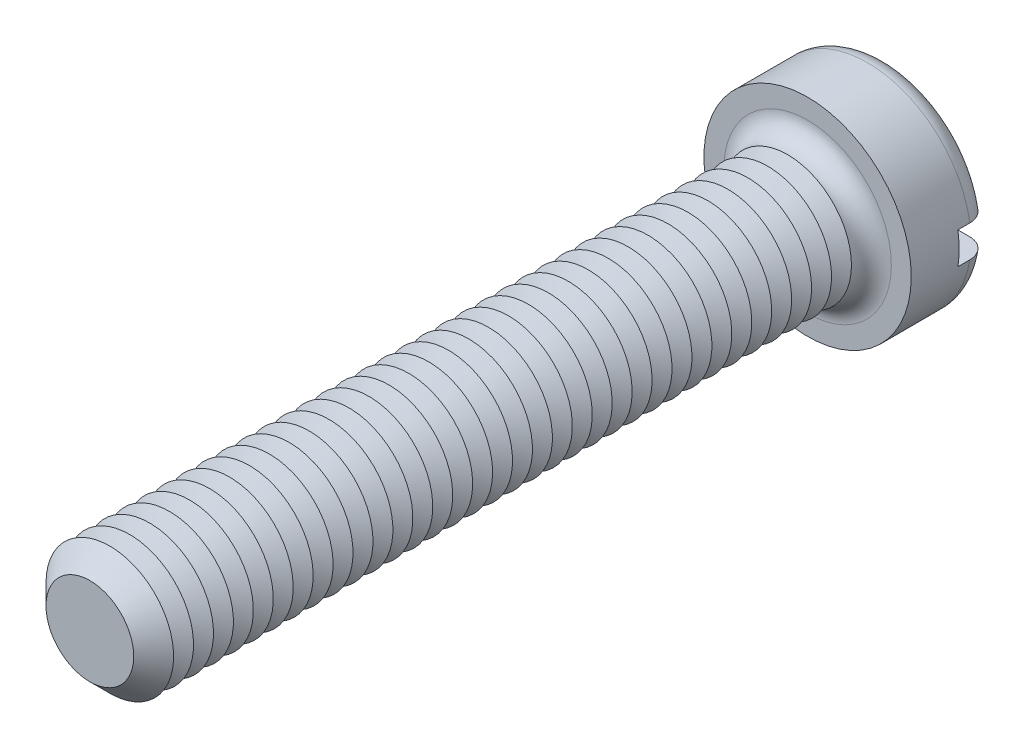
ISO-10303-21;
HEADER;
FILE_DESCRIPTION(('STEP AP214'),'2;1');
FILE_NAME('part.step','',(''),(''),'','','');
FILE_SCHEMA(('AUTOMOTIVE_DESIGN { 1 0 10303 214 1 1 1 1 }'));
ENDSEC;
DATA;
#1=APPLICATION_CONTEXT('core data for automotive mechanical design processes');
#2=APPLICATION_PROTOCOL_DEFINITION('international standard','automotive_design',2000,#1);
#3=PRODUCT_CONTEXT('',#1,'mechanical');
#4=PRODUCT('Part','Part','',(#3));
#5=PRODUCT_RELATED_PRODUCT_CATEGORY('part','',(#4));
#6=PRODUCT_DEFINITION_FORMATION('','',#4);
#7=PRODUCT_DEFINITION_CONTEXT('part definition',#1,'design');
#8=PRODUCT_DEFINITION('design','',#6,#7);
#9=PRODUCT_DEFINITION_SHAPE('','',#8);
#10=(LENGTH_UNIT() NAMED_UNIT(*) SI_UNIT(.MILLI.,.METRE.));
#11=(NAMED_UNIT(*) PLANE_ANGLE_UNIT() SI_UNIT($,.RADIAN.));
#12=(NAMED_UNIT(*) SI_UNIT($,.STERADIAN.) SOLID_ANGLE_UNIT());
#13=UNCERTAINTY_MEASURE_WITH_UNIT(LENGTH_MEASURE(1.E-05),#10,'distance_accuracy_value','');
#14=(GEOMETRIC_REPRESENTATION_CONTEXT(3) GLOBAL_UNCERTAINTY_ASSIGNED_CONTEXT((#13)) GLOBAL_UNIT_ASSIGNED_CONTEXT((#10,
#11,#12)) REPRESENTATION_CONTEXT('',''));
#15=CARTESIAN_POINT('',(0.,0.,0.));
#16=DIRECTION('',(0.,0.,1.));
#17=DIRECTION('',(1.,0.,0.));
#18=AXIS2_PLACEMENT_3D('',#15,#16,#17);
#19=CARTESIAN_POINT('',(0.,0.,-5.));
#20=DIRECTION('',(0.,0.,1.));
#21=DIRECTION('',(1.,0.,0.));
#22=AXIS2_PLACEMENT_3D('',#19,#20,#21);
#23=PLANE('',#22);
#24=CARTESIAN_POINT('',(0.,0.,-5.));
#25=DIRECTION('',(0.,0.,1.));
#26=DIRECTION('',(1.,0.,0.));
#27=AXIS2_PLACEMENT_3D('',#24,#25,#26);
#28=CIRCLE('',#27,5.25);
#29=CARTESIAN_POINT('',(-5.15388203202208,1.,-5.));
#30=VERTEX_POINT('',#29);
#31=CARTESIAN_POINT('',(5.15388203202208,1.,-5.));
#32=VERTEX_POINT('',#31);
#33=EDGE_CURVE('E116',#30,#32,#28,.F.);
#34=ORIENTED_EDGE('',*,*,#33,.T.);
#35=DIRECTION('',(1.,0.,0.));
#36=VECTOR('',#35,1.);
#37=CARTESIAN_POINT('',(-6.5,1.,-5.));
#38=LINE('',#37,#36);
#39=EDGE_CURVE('E111',#30,#32,#38,.T.);
#40=ORIENTED_EDGE('',*,*,#39,.F.);
#41=EDGE_LOOP('',(#34,#40));
#42=FACE_BOUND('',#41,.T.);
#43=ADVANCED_FACE('F39',(#42),#23,.F.);
#44=CARTESIAN_POINT('',(0.,0.,-3.75));
#45=DIRECTION('',(0.,0.,1.));
#46=DIRECTION('',(1.,0.,0.));
#47=AXIS2_PLACEMENT_3D('',#44,#45,#46);
#48=TOROIDAL_SURFACE('',#47,5.25,1.25);
#49=CARTESIAN_POINT('',(-6.04655789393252,1.,-4.63904490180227));
#50=CARTESIAN_POINT('',(-5.99546860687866,1.,-4.68885774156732));
#51=CARTESIAN_POINT('',(-5.94008472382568,1.,-4.73434760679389));
#52=CARTESIAN_POINT('',(-5.8223927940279,1.,-4.81538052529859));
#53=CARTESIAN_POINT('',(-5.7600753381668,1.,-4.85090982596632));
#54=CARTESIAN_POINT('',(-5.63044351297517,1.,-4.91100606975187));
#55=CARTESIAN_POINT('',(-5.56313479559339,1.,-4.93558519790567));
#56=CARTESIAN_POINT('',(-5.42539577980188,1.,-4.97322457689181));
#57=CARTESIAN_POINT('',(-5.35496625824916,1.,-4.98628767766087));
#58=CARTESIAN_POINT('',(-5.21212635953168,1.,-5.00070478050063));
#59=CARTESIAN_POINT('',(-5.13970265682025,1.,-5.00192674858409));
#60=CARTESIAN_POINT('',(-4.99565121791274,1.,-4.99234085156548));
#61=CARTESIAN_POINT('',(-4.92402357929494,1.,-4.98153152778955));
#62=CARTESIAN_POINT('',(-4.78274786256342,1.,-4.94801424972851));
#63=CARTESIAN_POINT('',(-4.71313137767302,1.,-4.92517296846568));
#64=CARTESIAN_POINT('',(-4.57871041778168,1.,-4.86813760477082));
#65=CARTESIAN_POINT('',(-4.51390612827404,1.,-4.83394308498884));
#66=CARTESIAN_POINT('',(-4.39095493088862,1.,-4.75508341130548));
#67=CARTESIAN_POINT('',(-4.33281197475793,1.,-4.7104120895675));
#68=CARTESIAN_POINT('',(-4.22499800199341,1.,-4.61179869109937));
#69=CARTESIAN_POINT('',(-4.17532640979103,1.,-4.55785724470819));
#70=CARTESIAN_POINT('',(-4.08677450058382,1.,-4.4431082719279));
#71=CARTESIAN_POINT('',(-4.0477350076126,1.,-4.38242369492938));
#72=CARTESIAN_POINT('',(-3.98074296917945,1.,-4.25521412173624));
#73=CARTESIAN_POINT('',(-3.95278836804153,1.,-4.18869021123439));
#74=CARTESIAN_POINT('',(-3.90959497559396,1.,-4.0537026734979));
#75=CARTESIAN_POINT('',(-3.89401985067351,1.,-3.98534663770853));
#76=CARTESIAN_POINT('',(-3.8748586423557,1.,-3.84697740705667));
#77=CARTESIAN_POINT('',(-3.87127067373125,1.,-3.7769644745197));
#78=CARTESIAN_POINT('',(-3.8761573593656,1.,-3.63892215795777));
#79=CARTESIAN_POINT('',(-3.88436651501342,1.,-3.57088319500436));
#80=CARTESIAN_POINT('',(-3.91207743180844,1.,-3.43714958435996));
#81=CARTESIAN_POINT('',(-3.93157911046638,1.,-3.37145491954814));
#82=CARTESIAN_POINT('',(-3.98125045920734,1.,-3.24411474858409));
#83=CARTESIAN_POINT('',(-4.01143761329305,1.,-3.18247607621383));
#84=CARTESIAN_POINT('',(-4.08150210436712,1.,-3.064981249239));
#85=CARTESIAN_POINT('',(-4.12138048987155,1.,-3.0091257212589));
#86=CARTESIAN_POINT('',(-4.2106718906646,1.,-2.90336353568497));
#87=CARTESIAN_POINT('',(-4.26028693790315,1.,-2.85362751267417));
#88=CARTESIAN_POINT('',(-4.36696587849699,1.,-2.76291710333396));
#89=CARTESIAN_POINT('',(-4.42403082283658,1.,-2.72194395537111));
#90=CARTESIAN_POINT('',(-4.54567957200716,1.,-2.64877280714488));
#91=CARTESIAN_POINT('',(-4.61042643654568,1.,-2.61684571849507));
#92=CARTESIAN_POINT('',(-4.74430563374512,1.,-2.56412359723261));
#93=CARTESIAN_POINT('',(-4.81343838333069,1.,-2.54332962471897));
#94=CARTESIAN_POINT('',(-4.95527237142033,1.,-2.51320471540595));
#95=CARTESIAN_POINT('',(-5.0280120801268,1.,-2.50405449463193));
#96=CARTESIAN_POINT('',(-5.17399775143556,1.,-2.49810126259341));
#97=CARTESIAN_POINT('',(-5.24724372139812,1.,-2.50129843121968));
#98=CARTESIAN_POINT('',(-5.3921014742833,1.,-2.52000776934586));
#99=CARTESIAN_POINT('',(-5.4637142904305,1.,-2.53551191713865));
#100=CARTESIAN_POINT('',(-5.60326680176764,1.,-2.57846304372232));
#101=CARTESIAN_POINT('',(-5.67120668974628,1.,-2.60590939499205));
#102=CARTESIAN_POINT('',(-5.80064060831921,1.,-2.67164926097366));
#103=CARTESIAN_POINT('',(-5.862199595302,1.,-2.7098148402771));
#104=CARTESIAN_POINT('',(-5.9779079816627,1.,-2.79608690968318));
#105=CARTESIAN_POINT('',(-6.03205795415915,1.,-2.84419263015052));
#106=CARTESIAN_POINT('',(-6.13055119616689,1.,-2.94820522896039));
#107=CARTESIAN_POINT('',(-6.17502887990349,1.,-3.00398483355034));
#108=CARTESIAN_POINT('',(-6.25384180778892,1.,-3.12230113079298));
#109=CARTESIAN_POINT('',(-6.28817779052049,1.,-3.18483733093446));
#110=CARTESIAN_POINT('',(-6.34527986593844,1.,-3.31401726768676));
#111=CARTESIAN_POINT('',(-6.36818984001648,1.,-3.38059742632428));
#112=CARTESIAN_POINT('',(-6.40240470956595,1.,-3.5166725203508));
#113=CARTESIAN_POINT('',(-6.41371067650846,1.,-3.58616718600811));
#114=CARTESIAN_POINT('',(-6.42433240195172,1.,-3.72550026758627));
#115=CARTESIAN_POINT('',(-6.4237441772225,1.,-3.79533138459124));
#116=CARTESIAN_POINT('',(-6.41082814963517,1.,-3.93391789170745));
#117=CARTESIAN_POINT('',(-6.39849757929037,1.,-4.00267302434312));
#118=CARTESIAN_POINT('',(-6.36249191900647,1.,-4.13704597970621));
#119=CARTESIAN_POINT('',(-6.33883072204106,1.,-4.20266753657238));
#120=CARTESIAN_POINT('',(-6.28088769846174,1.,-4.32897165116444));
#121=CARTESIAN_POINT('',(-6.24661890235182,1.,-4.38966015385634));
#122=CARTESIAN_POINT('',(-6.18404039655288,1.,-4.48163773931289));
#123=CARTESIAN_POINT('',(-6.15876600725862,1.,-4.51503333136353));
#124=CARTESIAN_POINT('',(-6.10500607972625,1.,-4.5791298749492));
#125=CARTESIAN_POINT('',(-6.07652056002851,1.,-4.60983084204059));
#126=CARTESIAN_POINT('',(-6.04655789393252,1.,-4.63904490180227));
#127=B_SPLINE_CURVE_WITH_KNOTS('',3,(#49,#50,#51,#52,#53,#54,#55,#56,#57,#58,#59,#60,#61,#62,
#63,#64,#65,#66,#67,#68,#69,#70,#71,#72,#73,#74,#75,#76,#77,#78,#79,#80,#81,#82,#83,#84,#85,#86,
#87,#88,#89,#90,#91,#92,#93,#94,#95,#96,#97,#98,#99,#100,#101,#102,#103,#104,#105,#106,#107,
#108,#109,#110,#111,#112,#113,#114,#115,#116,#117,#118,#119,#120,#121,#122,#123,#124,#125,#126),
.UNSPECIFIED.,.T.,.F.,(4,2,2,2,2,2,2,2,2,2,2,2,2,2,2,2,2,2,2,2,2,2,2,2,2,2,2,2,2,2,2,2,2,2,2,2,
2,2,4),(0.,0.213907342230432,0.428108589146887,0.642070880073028,0.855980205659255,
1.07227200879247,1.28859003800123,1.50735715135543,1.72613269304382,1.94503735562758,
2.16392713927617,2.37933295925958,2.59469881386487,2.80399176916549,3.01325180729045,
3.2178754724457,3.42249764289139,3.62745618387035,3.83243690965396,4.04223444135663,
4.25206160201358,4.46763253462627,4.68322399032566,4.90212226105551,5.12102372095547,
5.33978261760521,5.55853002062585,5.77477015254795,5.99099354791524,6.20398686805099,
6.41696467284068,6.62718821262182,6.83739233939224,7.0459002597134,7.25445733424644,
7.46275934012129,7.67080647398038,7.79625882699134,7.92171045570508),.UNSPECIFIED.);
#128=CARTESIAN_POINT('',(-6.42261628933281,1.,-3.74999999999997));
#129=VERTEX_POINT('',#128);
#130=EDGE_CURVE('E451',#129,#30,#127,.T.);
#131=ORIENTED_EDGE('',*,*,#130,.F.);
#132=CARTESIAN_POINT('',(0.,0.,-3.75));
#133=DIRECTION('',(0.,0.,1.));
#134=DIRECTION('',(1.,0.,0.));
#135=AXIS2_PLACEMENT_3D('',#132,#133,#134);
#136=CIRCLE('',#135,6.5);
#137=CARTESIAN_POINT('',(6.42261628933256,1.,-3.75));
#138=VERTEX_POINT('',#137);
#139=EDGE_CURVE('E125',#138,#129,#136,.T.);
#140=ORIENTED_EDGE('',*,*,#139,.F.);
#141=CARTESIAN_POINT('',(4.06944999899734,1.,-4.4133199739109));
#142=CARTESIAN_POINT('',(4.10828271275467,1.,-4.47354709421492));
#143=CARTESIAN_POINT('',(4.15233880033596,1.,-4.53047894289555));
#144=CARTESIAN_POINT('',(4.24946916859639,1.,-4.63614530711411));
#145=CARTESIAN_POINT('',(4.3025574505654,1.,-4.68486685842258));
#146=CARTESIAN_POINT('',(4.41603250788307,1.,-4.77271114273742));
#147=CARTESIAN_POINT('',(4.47640839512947,1.,-4.8118479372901));
#148=CARTESIAN_POINT('',(4.60277035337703,1.,-4.87959878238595));
#149=CARTESIAN_POINT('',(4.66875480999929,1.,-4.90821584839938));
#150=CARTESIAN_POINT('',(4.80558589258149,1.,-4.95456537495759));
#151=CARTESIAN_POINT('',(4.87649196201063,1.,-4.97212253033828));
#152=CARTESIAN_POINT('',(5.02024710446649,1.,-4.99514979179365));
#153=CARTESIAN_POINT('',(5.09309636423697,1.,-5.00061873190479));
#154=CARTESIAN_POINT('',(5.23902872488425,1.,-4.99926689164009));
#155=CARTESIAN_POINT('',(5.31211131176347,1.,-4.99238812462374));
#156=CARTESIAN_POINT('',(5.45605806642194,1.,-4.96635140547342));
#157=CARTESIAN_POINT('',(5.52692231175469,1.,-4.94719388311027));
#158=CARTESIAN_POINT('',(5.66376170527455,1.,-4.89728421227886));
#159=CARTESIAN_POINT('',(5.72977335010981,1.,-4.86663219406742));
#160=CARTESIAN_POINT('',(5.85560715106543,1.,-4.79452334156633));
#161=CARTESIAN_POINT('',(5.91542977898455,1.,-4.7530673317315));
#162=CARTESIAN_POINT('',(6.02626022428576,1.,-4.66116821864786));
#163=CARTESIAN_POINT('',(6.07738307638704,1.,-4.6108638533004));
#164=CARTESIAN_POINT('',(6.17030947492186,1.,-4.50227823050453));
#165=CARTESIAN_POINT('',(6.2121137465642,1.,-4.44399759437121));
#166=CARTESIAN_POINT('',(6.28460268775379,1.,-4.32200305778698));
#167=CARTESIAN_POINT('',(6.31543589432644,1.,-4.2583773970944));
#168=CARTESIAN_POINT('',(6.36586009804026,1.,-4.12681721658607));
#169=CARTESIAN_POINT('',(6.38545178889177,1.,-4.0588829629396));
#170=CARTESIAN_POINT('',(6.41265760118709,1.,-3.92136007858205));
#171=CARTESIAN_POINT('',(6.42038873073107,1.,-3.85179457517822));
#172=CARTESIAN_POINT('',(6.42401070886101,1.,-3.7123569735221));
#173=CARTESIAN_POINT('',(6.41990193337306,1.,-3.64248488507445));
#174=CARTESIAN_POINT('',(6.40000894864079,1.,-3.50470871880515));
#175=CARTESIAN_POINT('',(6.38427119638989,1.,-3.43679792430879));
#176=CARTESIAN_POINT('',(6.34164491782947,1.,-3.30457296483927));
#177=CARTESIAN_POINT('',(6.31475638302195,1.,-3.24025880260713));
#178=CARTESIAN_POINT('',(6.2505455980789,1.,-3.11686791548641));
#179=CARTESIAN_POINT('',(6.21319759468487,1.,-3.05780459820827));
#180=CARTESIAN_POINT('',(6.12919411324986,1.,-2.94671919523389));
#181=CARTESIAN_POINT('',(6.08253833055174,1.,-2.89469734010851));
#182=CARTESIAN_POINT('',(5.98083387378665,1.,-2.79868150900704));
#183=CARTESIAN_POINT('',(5.92571704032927,1.,-2.75475975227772));
#184=CARTESIAN_POINT('',(5.80897194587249,1.,-2.67665277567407));
#185=CARTESIAN_POINT('',(5.74734329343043,1.,-2.64246814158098));
#186=CARTESIAN_POINT('',(5.6184644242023,1.,-2.58431810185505));
#187=CARTESIAN_POINT('',(5.55115102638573,1.,-2.56049275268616));
#188=CARTESIAN_POINT('',(5.41351272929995,1.,-2.52429868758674));
#189=CARTESIAN_POINT('',(5.34318759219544,1.,-2.51193087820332));
#190=CARTESIAN_POINT('',(5.20041507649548,1.,-2.49882112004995));
#191=CARTESIAN_POINT('',(5.12795169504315,1.,-2.49825332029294));
#192=CARTESIAN_POINT('',(4.98393373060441,1.,-2.50914771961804));
#193=CARTESIAN_POINT('',(4.91237921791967,1.,-2.52061084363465));
#194=CARTESIAN_POINT('',(4.77137358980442,1.,-2.55542281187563));
#195=CARTESIAN_POINT('',(4.70195472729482,1.,-2.57890245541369));
#196=CARTESIAN_POINT('',(4.56803538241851,1.,-2.63717701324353));
#197=CARTESIAN_POINT('',(4.50353509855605,1.,-2.67197238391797));
#198=CARTESIAN_POINT('',(4.38131858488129,1.,-2.7519648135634));
#199=CARTESIAN_POINT('',(4.32360365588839,1.,-2.79716386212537));
#200=CARTESIAN_POINT('',(4.21673400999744,1.,-2.89675634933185));
#201=CARTESIAN_POINT('',(4.16757871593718,1.,-2.95114916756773));
#202=CARTESIAN_POINT('',(4.08014713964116,1.,-3.06667703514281));
#203=CARTESIAN_POINT('',(4.04170608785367,1.,-3.12768727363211));
#204=CARTESIAN_POINT('',(3.97596192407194,1.,-3.25543782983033));
#205=CARTESIAN_POINT('',(3.94865624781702,1.,-3.32217682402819));
#206=CARTESIAN_POINT('',(3.9067737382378,1.,-3.45745603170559));
#207=CARTESIAN_POINT('',(3.89185707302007,1.,-3.52589108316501));
#208=CARTESIAN_POINT('',(3.87400755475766,1.,-3.66432360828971));
#209=CARTESIAN_POINT('',(3.87107601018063,1.,-3.73432125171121));
#210=CARTESIAN_POINT('',(3.8772387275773,1.,-3.87228267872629));
#211=CARTESIAN_POINT('',(3.88607933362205,1.,-3.94025811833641));
#212=CARTESIAN_POINT('',(3.91502769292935,1.,-4.07370133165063));
#213=CARTESIAN_POINT('',(3.93512131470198,1.,-4.1391721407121));
#214=CARTESIAN_POINT('',(3.9752037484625,1.,-4.23926719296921));
#215=CARTESIAN_POINT('',(3.99171171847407,1.,-4.27532618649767));
#216=CARTESIAN_POINT('',(4.02809737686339,1.,-4.34569933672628));
#217=CARTESIAN_POINT('',(4.04797497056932,1.,-4.3800135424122));
#218=CARTESIAN_POINT('',(4.06944999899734,1.,-4.4133199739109));
#219=B_SPLINE_CURVE_WITH_KNOTS('',3,(#141,#142,#143,#144,#145,#146,#147,#148,#149,#150,#151,
#152,#153,#154,#155,#156,#157,#158,#159,#160,#161,#162,#163,#164,#165,#166,#167,#168,#169,#170,
#171,#172,#173,#174,#175,#176,#177,#178,#179,#180,#181,#182,#183,#184,#185,#186,#187,#188,#189,
#190,#191,#192,#193,#194,#195,#196,#197,#198,#199,#200,#201,#202,#203,#204,#205,#206,#207,#208,
#209,#210,#211,#212,#213,#214,#215,#216,#217,#218),.UNSPECIFIED.,.T.,.F.,(4,2,2,2,2,2,2,2,2,2,2,
2,2,2,2,2,2,2,2,2,2,2,2,2,2,2,2,2,2,2,2,2,2,2,2,2,2,2,4),(0.,0.214833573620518,
0.430003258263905,0.644855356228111,0.859645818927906,1.0777603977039,1.29589601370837,
1.51505870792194,1.73421373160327,1.95150241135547,2.16877451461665,2.38290237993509,
2.59701357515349,2.8081044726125,3.01918234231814,3.22816416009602,3.43713934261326,
3.64528416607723,3.85342914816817,4.06209119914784,4.27076008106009,4.48120788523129,
4.69166834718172,4.90489186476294,5.11813225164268,5.33451752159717,5.55091942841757,
5.76972860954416,5.98854661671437,6.20740650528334,6.42625163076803,6.64151774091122,
6.85673425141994,7.0658317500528,7.27495207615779,7.47963858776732,7.68406862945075,
7.80287790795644,7.92168384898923),.UNSPECIFIED.);
#220=EDGE_CURVE('E453',#32,#138,#219,.T.);
#221=ORIENTED_EDGE('',*,*,#220,.F.);
#222=ORIENTED_EDGE('',*,*,#33,.F.);
#223=EDGE_LOOP('',(#131,#140,#221,#222));
#224=FACE_BOUND('',#223,.T.);
#225=ADVANCED_FACE('F435',(#224),#48,.T.);
#226=CARTESIAN_POINT('',(0.,0.,-5.));
#227=DIRECTION('',(0.,0.,1.));
#228=DIRECTION('',(1.,0.,0.));
#229=AXIS2_PLACEMENT_3D('',#226,#227,#228);
#230=CYLINDRICAL_SURFACE('',#229,6.5);
#231=DIRECTION('',(0.,0.,1.));
#232=VECTOR('',#231,1.);
#233=CARTESIAN_POINT('',(6.42261628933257,1.,-5.));
#234=LINE('',#233,#232);
#235=CARTESIAN_POINT('',(6.42261628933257,1.,-3.));
#236=VERTEX_POINT('',#235);
#237=EDGE_CURVE('E467',#138,#236,#234,.T.);
#238=ORIENTED_EDGE('',*,*,#237,.F.);
#239=ORIENTED_EDGE('',*,*,#139,.T.);
#240=DIRECTION('',(0.,0.,1.));
#241=VECTOR('',#240,1.);
#242=CARTESIAN_POINT('',(-6.42261628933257,1.,-5.));
#243=LINE('',#242,#241);
#244=CARTESIAN_POINT('',(-6.42261628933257,1.,-3.));
#245=VERTEX_POINT('',#244);
#246=EDGE_CURVE('E63',#245,#129,#243,.F.);
#247=ORIENTED_EDGE('',*,*,#246,.F.);
#248=CARTESIAN_POINT('',(0.,0.,-3.));
#249=DIRECTION('',(0.,0.,-1.));
#250=DIRECTION('',(-1.,0.,0.));
#251=AXIS2_PLACEMENT_3D('',#248,#249,#250);
#252=CIRCLE('',#251,6.5);
#253=CARTESIAN_POINT('',(-6.42261628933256,-0.999999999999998,-3.));
#254=VERTEX_POINT('',#253);
#255=EDGE_CURVE('E43',#245,#254,#252,.F.);
#256=ORIENTED_EDGE('',*,*,#255,.T.);
#257=DIRECTION('',(0.,0.,1.));
#258=VECTOR('',#257,1.);
#259=CARTESIAN_POINT('',(-6.42261628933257,-0.999999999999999,-5.));
#260=LINE('',#259,#258);
#261=CARTESIAN_POINT('',(-6.42261628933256,-0.999999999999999,-3.75));
#262=VERTEX_POINT('',#261);
#263=EDGE_CURVE('E464',#262,#254,#260,.T.);
#264=ORIENTED_EDGE('',*,*,#263,.F.);
#265=CARTESIAN_POINT('',(6.42261628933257,-1.,-3.75));
#266=VERTEX_POINT('',#265);
#267=EDGE_CURVE('E127',#262,#266,#136,.T.);
#268=ORIENTED_EDGE('',*,*,#267,.T.);
#269=DIRECTION('',(0.,0.,1.));
#270=VECTOR('',#269,1.);
#271=CARTESIAN_POINT('',(6.42261628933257,-1.,-5.));
#272=LINE('',#271,#270);
#273=CARTESIAN_POINT('',(6.42261628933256,-1.,-3.));
#274=VERTEX_POINT('',#273);
#275=EDGE_CURVE('E55',#274,#266,#272,.F.);
#276=ORIENTED_EDGE('',*,*,#275,.F.);
#277=EDGE_CURVE('E11',#274,#236,#252,.F.);
#278=ORIENTED_EDGE('',*,*,#277,.T.);
#279=EDGE_LOOP('',(#238,#239,#247,#256,#264,#268,#276,#278));
#280=FACE_BOUND('',#279,.T.);
#281=CARTESIAN_POINT('',(0.,0.,0.));
#282=DIRECTION('',(0.,0.,1.));
#283=DIRECTION('',(1.,0.,0.));
#284=AXIS2_PLACEMENT_3D('',#281,#282,#283);
#285=CIRCLE('',#284,6.5);
#286=CARTESIAN_POINT('',(6.5,0.,0.));
#287=VERTEX_POINT('',#286);
#288=EDGE_CURVE('E470',#287,#287,#285,.T.);
#289=ORIENTED_EDGE('',*,*,#288,.F.);
#290=EDGE_LOOP('',(#289));
#291=FACE_BOUND('',#290,.T.);
#292=ADVANCED_FACE('F431',(#280,#291),#230,.T.);
#293=CARTESIAN_POINT('',(5.15388203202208,-1.,-5.));
#294=VERTEX_POINT('',#293);
#295=CARTESIAN_POINT('',(-5.15388203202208,-0.999999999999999,-5.));
#296=VERTEX_POINT('',#295);
#297=EDGE_CURVE('E109',#294,#296,#28,.F.);
#298=ORIENTED_EDGE('',*,*,#297,.T.);
#299=DIRECTION('',(-1.,0.,0.));
#300=VECTOR('',#299,1.);
#301=CARTESIAN_POINT('',(-6.5,-0.999999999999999,-5.));
#302=LINE('',#301,#300);
#303=EDGE_CURVE('E96',#294,#296,#302,.T.);
#304=ORIENTED_EDGE('',*,*,#303,.F.);
#305=EDGE_LOOP('',(#298,#304));
#306=FACE_BOUND('',#305,.T.);
#307=ADVANCED_FACE('F108',(#306),#23,.F.);
#308=CARTESIAN_POINT('',(0.,0.,0.));
#309=DIRECTION('',(0.,0.,1.));
#310=DIRECTION('',(1.,0.,0.));
#311=AXIS2_PLACEMENT_3D('',#308,#309,#310);
#312=PLANE('',#311);
#313=CARTESIAN_POINT('',(0.,0.,0.));
#314=DIRECTION('',(0.,0.,1.));
#315=DIRECTION('',(1.,0.,0.));
#316=AXIS2_PLACEMENT_3D('',#313,#314,#315);
#317=CIRCLE('',#316,5.25);
#318=CARTESIAN_POINT('',(5.25,0.,0.));
#319=VERTEX_POINT('',#318);
#320=EDGE_CURVE('E115',#319,#319,#317,.F.);
#321=ORIENTED_EDGE('',*,*,#320,.T.);
#322=EDGE_LOOP('',(#321));
#323=FACE_BOUND('',#322,.T.);
#324=ORIENTED_EDGE('',*,*,#288,.T.);
#325=EDGE_LOOP('',(#324));
#326=FACE_BOUND('',#325,.T.);
#327=ADVANCED_FACE('F430',(#323,#326),#312,.T.);
#328=CARTESIAN_POINT('',(-6.04655789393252,-0.999999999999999,-4.63904490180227));
#329=CARTESIAN_POINT('',(-6.0966604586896,-0.999999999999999,-4.59018532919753));
#330=CARTESIAN_POINT('',(-6.14270501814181,-0.999999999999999,-4.53709744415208));
#331=CARTESIAN_POINT('',(-6.22528519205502,-0.999999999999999,-4.42391631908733));
#332=CARTESIAN_POINT('',(-6.26181074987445,-0.999999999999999,-4.36381576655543));
#333=CARTESIAN_POINT('',(-6.32422109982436,-0.999999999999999,-4.23831836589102));
#334=CARTESIAN_POINT('',(-6.35010658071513,-0.999999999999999,-4.17292186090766));
#335=CARTESIAN_POINT('',(-6.39044668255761,-0.999999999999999,-4.03870925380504));
#336=CARTESIAN_POINT('',(-6.40490396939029,-0.999999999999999,-3.96989395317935));
#337=CARTESIAN_POINT('',(-6.42190814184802,-0.999999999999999,-3.83122595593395));
#338=CARTESIAN_POINT('',(-6.4245257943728,-0.999999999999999,-3.76138193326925));
#339=CARTESIAN_POINT('',(-6.41796432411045,-0.999999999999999,-3.62224935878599));
#340=CARTESIAN_POINT('',(-6.40878509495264,-0.999999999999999,-3.55296081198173));
#341=CARTESIAN_POINT('',(-6.37894560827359,-0.999999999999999,-3.41709241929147));
#342=CARTESIAN_POINT('',(-6.35831520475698,-0.999999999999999,-3.35050601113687));
#343=CARTESIAN_POINT('',(-6.30620980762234,-0.999999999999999,-3.22172312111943));
#344=CARTESIAN_POINT('',(-6.2747347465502,-0.999999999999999,-3.15952666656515));
#345=CARTESIAN_POINT('',(-6.20172710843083,-0.999999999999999,-3.04101762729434));
#346=CARTESIAN_POINT('',(-6.16015622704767,-0.999999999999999,-2.98472864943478));
#347=CARTESIAN_POINT('',(-6.06823774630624,-0.999999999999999,-2.87984578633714));
#348=CARTESIAN_POINT('',(-6.01788981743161,-0.999999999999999,-2.83125219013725));
#349=CARTESIAN_POINT('',(-5.90933830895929,-0.999999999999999,-2.74262118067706));
#350=CARTESIAN_POINT('',(-5.85106338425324,-0.999999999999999,-2.70267117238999));
#351=CARTESIAN_POINT('',(-5.72870702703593,-0.999999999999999,-2.63296796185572));
#352=CARTESIAN_POINT('',(-5.66462521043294,-0.999999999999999,-2.6032154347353));
#353=CARTESIAN_POINT('',(-5.53153273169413,-0.999999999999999,-2.55430842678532));
#354=CARTESIAN_POINT('',(-5.46246626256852,-0.999999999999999,-2.53530583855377));
#355=CARTESIAN_POINT('',(-5.32214267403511,-0.999999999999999,-2.5089831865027));
#356=CARTESIAN_POINT('',(-5.25088537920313,-0.999999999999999,-2.50166406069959));
#357=CARTESIAN_POINT('',(-5.10710123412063,-0.999999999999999,-2.49882202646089));
#358=CARTESIAN_POINT('',(-5.03457095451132,-0.999999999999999,-2.50347166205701));
#359=CARTESIAN_POINT('',(-4.8912897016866,-0.999999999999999,-2.52476029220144));
#360=CARTESIAN_POINT('',(-4.82053886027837,-0.999999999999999,-2.54140017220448));
#361=CARTESIAN_POINT('',(-4.68213257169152,-0.999999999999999,-2.58641614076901));
#362=CARTESIAN_POINT('',(-4.61451256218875,-0.999999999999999,-2.61490131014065));
#363=CARTESIAN_POINT('',(-4.48502801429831,-0.999999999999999,-2.68285095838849));
#364=CARTESIAN_POINT('',(-4.42316359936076,-0.999999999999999,-2.72231567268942));
#365=CARTESIAN_POINT('',(-4.30720694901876,-0.999999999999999,-2.81103994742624));
#366=CARTESIAN_POINT('',(-4.25309118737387,-0.999999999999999,-2.86026872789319));
#367=CARTESIAN_POINT('',(-4.15409408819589,-0.999999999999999,-2.9672764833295));
#368=CARTESIAN_POINT('',(-4.10921182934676,-0.999999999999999,-3.02505460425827));
#369=CARTESIAN_POINT('',(-4.03096584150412,-0.999999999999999,-3.14632492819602));
#370=CARTESIAN_POINT('',(-3.99739097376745,-0.999999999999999,-3.2096807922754));
#371=CARTESIAN_POINT('',(-3.94171839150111,-0.999999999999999,-3.34124912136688));
#372=CARTESIAN_POINT('',(-3.91961840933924,-0.999999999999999,-3.40946062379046));
#373=CARTESIAN_POINT('',(-3.88816636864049,-0.999999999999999,-3.54669256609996));
#374=CARTESIAN_POINT('',(-3.87846562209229,-0.999999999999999,-3.61563318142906));
#375=CARTESIAN_POINT('',(-3.87100568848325,-0.999999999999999,-3.75415397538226));
#376=CARTESIAN_POINT('',(-3.87324501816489,-0.999999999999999,-3.82373407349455));
#377=CARTESIAN_POINT('',(-3.88943589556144,-0.999999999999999,-3.96027701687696));
#378=CARTESIAN_POINT('',(-3.90318225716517,-0.999999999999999,-4.0272643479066));
#379=CARTESIAN_POINT('',(-3.94163954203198,-0.999999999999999,-4.1580093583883));
#380=CARTESIAN_POINT('',(-3.96635075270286,-0.999999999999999,-4.22176695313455));
#381=CARTESIAN_POINT('',(-4.026160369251,-0.999999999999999,-4.34483320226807));
#382=CARTESIAN_POINT('',(-4.06134035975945,-0.999999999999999,-4.40410214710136));
#383=CARTESIAN_POINT('',(-4.14090865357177,-0.999999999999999,-4.51609417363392));
#384=CARTESIAN_POINT('',(-4.18529811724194,-0.999999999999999,-4.56881642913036));
#385=CARTESIAN_POINT('',(-4.2832649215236,-0.999999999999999,-4.66770177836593));
#386=CARTESIAN_POINT('',(-4.33705327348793,-0.999999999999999,-4.71365579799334));
#387=CARTESIAN_POINT('',(-4.45141776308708,-0.999999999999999,-4.79615385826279));
#388=CARTESIAN_POINT('',(-4.51199483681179,-0.999999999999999,-4.83269659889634));
#389=CARTESIAN_POINT('',(-4.63989216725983,-0.999999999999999,-4.89626962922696));
#390=CARTESIAN_POINT('',(-4.70734508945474,-0.999999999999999,-4.92303326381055));
#391=CARTESIAN_POINT('',(-4.84575497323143,-0.999999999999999,-4.96500199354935));
#392=CARTESIAN_POINT('',(-4.91671207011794,-0.999999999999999,-4.98020664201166));
#393=CARTESIAN_POINT('',(-5.06097761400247,-0.999999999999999,-4.9987306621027));
#394=CARTESIAN_POINT('',(-5.13430353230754,-0.999999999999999,-5.00191441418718));
#395=CARTESIAN_POINT('',(-5.28046546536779,-0.999999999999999,-4.99587686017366));
#396=CARTESIAN_POINT('',(-5.35330135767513,-0.999999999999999,-4.98665256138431));
#397=CARTESIAN_POINT('',(-5.49610354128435,-0.999999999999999,-4.95604184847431));
#398=CARTESIAN_POINT('',(-5.56607890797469,-0.999999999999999,-4.93469772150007));
#399=CARTESIAN_POINT('',(-5.70131538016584,-0.999999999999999,-4.88041956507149));
#400=CARTESIAN_POINT('',(-5.76658233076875,-0.999999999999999,-4.84750021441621));
#401=CARTESIAN_POINT('',(-5.86782577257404,-0.999999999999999,-4.78498748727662));
#402=CARTESIAN_POINT('',(-5.90579749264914,-0.999999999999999,-4.75856648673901));
#403=CARTESIAN_POINT('',(-5.97862186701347,-0.999999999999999,-4.70172646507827));
#404=CARTESIAN_POINT('',(-6.0134745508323,-0.999999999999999,-4.6713074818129));
#405=CARTESIAN_POINT('',(-6.04655789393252,-0.999999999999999,-4.63904490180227));
#406=B_SPLINE_CURVE_WITH_KNOTS('',3,(#328,#329,#330,#331,#332,#333,#334,#335,#336,#337,#338,
#339,#340,#341,#342,#343,#344,#345,#346,#347,#348,#349,#350,#351,#352,#353,#354,#355,#356,#357,
#358,#359,#360,#361,#362,#363,#364,#365,#366,#367,#368,#369,#370,#371,#372,#373,#374,#375,#376,
#377,#378,#379,#380,#381,#382,#383,#384,#385,#386,#387,#388,#389,#390,#391,#392,#393,#394,#395,
#396,#397,#398,#399,#400,#401,#402,#403,#404,#405),.UNSPECIFIED.,.T.,.F.,(4,2,2,2,2,2,2,2,2,2,2,
2,2,2,2,2,2,2,2,2,2,2,2,2,2,2,2,2,2,2,2,2,2,2,2,2,2,2,4),(0.,0.209780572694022,
0.419781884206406,0.629769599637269,0.839708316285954,1.04839053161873,1.2570746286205,
1.46521720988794,1.67336108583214,1.88230736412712,2.09126148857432,2.30223890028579,
2.51323027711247,2.72713284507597,2.94105258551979,3.15807345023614,3.37511034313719,
3.59419176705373,3.81327788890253,4.03168404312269,4.25006839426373,4.46411376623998,
4.67811682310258,4.88595885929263,5.09377507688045,5.29796268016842,5.50215563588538,
5.70798353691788,5.91383738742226,6.12510741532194,6.33640661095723,6.55309998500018,
6.76980173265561,6.98894112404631,7.20813337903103,7.42656551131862,7.64472163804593,
7.78324365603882,7.92176436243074),.UNSPECIFIED.);
#407=EDGE_CURVE('E103',#296,#262,#406,.T.);
#408=ORIENTED_EDGE('',*,*,#407,.F.);
#409=ORIENTED_EDGE('',*,*,#297,.F.);
#410=CARTESIAN_POINT('',(4.06944999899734,-1.,-4.4133199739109));
#411=CARTESIAN_POINT('',(4.03213207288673,-1.,-4.3554312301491));
#412=CARTESIAN_POINT('',(3.9995849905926,-1.,-4.29441722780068));
#413=CARTESIAN_POINT('',(3.94511822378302,-1.,-4.16776604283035));
#414=CARTESIAN_POINT('',(3.92320762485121,-1.,-4.10212496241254));
#415=CARTESIAN_POINT('',(3.89078811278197,-1.,-3.96804412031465));
#416=CARTESIAN_POINT('',(3.88028409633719,-1.,-3.89960316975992));
#417=CARTESIAN_POINT('',(3.87107895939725,-1.,-3.76194650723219));
#418=CARTESIAN_POINT('',(3.87237511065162,-1.,-3.69273097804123));
#419=CARTESIAN_POINT('',(3.88662927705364,-1.,-3.55634460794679));
#420=CARTESIAN_POINT('',(3.89944923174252,-1.,-3.48915926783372));
#421=CARTESIAN_POINT('',(3.93611188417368,-1.,-3.35786953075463));
#422=CARTESIAN_POINT('',(3.95995518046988,-1.,-3.29376530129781));
#423=CARTESIAN_POINT('',(4.0180748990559,-1.,-3.16993562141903));
#424=CARTESIAN_POINT('',(4.05242297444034,-1.,-3.11024385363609));
#425=CARTESIAN_POINT('',(4.13041121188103,-1.,-2.9972793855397));
#426=CARTESIAN_POINT('',(4.17405248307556,-1.,-2.94400745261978));
#427=CARTESIAN_POINT('',(4.27058636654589,-1.,-2.8439150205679));
#428=CARTESIAN_POINT('',(4.32368948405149,-1.,-2.79729757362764));
#429=CARTESIAN_POINT('',(4.43679856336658,-1.,-2.71336600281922));
#430=CARTESIAN_POINT('',(4.49680546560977,-1.,-2.67605314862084));
#431=CARTESIAN_POINT('',(4.62370121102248,-1.,-2.61081752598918));
#432=CARTESIAN_POINT('',(4.69072799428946,-1.,-2.58316284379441));
#433=CARTESIAN_POINT('',(4.82843981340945,-1.,-2.5393441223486));
#434=CARTESIAN_POINT('',(4.899125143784,-1.,-2.52318100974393));
#435=CARTESIAN_POINT('',(5.04306377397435,-1.,-2.50267755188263));
#436=CARTESIAN_POINT('',(5.11633773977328,-1.,-2.49848181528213));
#437=CARTESIAN_POINT('',(5.26254809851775,-1.,-2.50249357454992));
#438=CARTESIAN_POINT('',(5.33548449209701,-1.,-2.51070104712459));
#439=CARTESIAN_POINT('',(5.4786703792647,-1.,-2.53930888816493));
#440=CARTESIAN_POINT('',(5.54892819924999,-1.,-2.5596675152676));
#441=CARTESIAN_POINT('',(5.68495799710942,-1.,-2.61204238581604));
#442=CARTESIAN_POINT('',(5.75073024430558,-1.,-2.64405792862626));
#443=CARTESIAN_POINT('',(5.8750178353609,-1.,-2.7184150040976));
#444=CARTESIAN_POINT('',(5.93361487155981,-1.,-2.76061995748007));
#445=CARTESIAN_POINT('',(6.04275377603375,-1.,-2.85440601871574));
#446=CARTESIAN_POINT('',(6.09329629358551,-1.,-2.90598637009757));
#447=CARTESIAN_POINT('',(6.18409572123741,-1.,-3.01622977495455));
#448=CARTESIAN_POINT('',(6.2244945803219,-1.,-3.07477592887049));
#449=CARTESIAN_POINT('',(6.29474798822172,-1.,-3.19788594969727));
#450=CARTESIAN_POINT('',(6.3246032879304,-1.,-3.26244938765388));
#451=CARTESIAN_POINT('',(6.37256001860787,-1.,-3.39491634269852));
#452=CARTESIAN_POINT('',(6.39079949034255,-1.,-3.46276990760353));
#453=CARTESIAN_POINT('',(6.41554133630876,-1.,-3.60058363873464));
#454=CARTESIAN_POINT('',(6.42204424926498,-1.,-3.67054370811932));
#455=CARTESIAN_POINT('',(6.42311237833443,-1.,-3.81007982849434));
#456=CARTESIAN_POINT('',(6.41775799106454,-1.,-3.879655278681));
#457=CARTESIAN_POINT('',(6.39543799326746,-1.,-4.01691664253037));
#458=CARTESIAN_POINT('',(6.3784725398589,-1.,-4.08460258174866));
#459=CARTESIAN_POINT('',(6.33344768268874,-1.,-4.21614537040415));
#460=CARTESIAN_POINT('',(6.30539273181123,-1.,-4.28000374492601));
#461=CARTESIAN_POINT('',(6.23902076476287,-1.,-4.40214140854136));
#462=CARTESIAN_POINT('',(6.20070356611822,-1.,-4.46042059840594));
#463=CARTESIAN_POINT('',(6.11467174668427,-1.,-4.5701315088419));
#464=CARTESIAN_POINT('',(6.06690270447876,-1.,-4.62152053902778));
#465=CARTESIAN_POINT('',(5.96350111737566,-1.,-4.715657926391));
#466=CARTESIAN_POINT('',(5.90786817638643,-1.,-4.75840584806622));
#467=CARTESIAN_POINT('',(5.78965380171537,-1.,-4.8345781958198));
#468=CARTESIAN_POINT('',(5.72700078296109,-1.,-4.86789149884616));
#469=CARTESIAN_POINT('',(5.59704977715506,-1.,-4.92369754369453));
#470=CARTESIAN_POINT('',(5.52975144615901,-1.,-4.94618948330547));
#471=CARTESIAN_POINT('',(5.39137621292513,-1.,-4.98006173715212));
#472=CARTESIAN_POINT('',(5.32025859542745,-1.,-4.99127571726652));
#473=CARTESIAN_POINT('',(5.17715081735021,-1.,-5.00177798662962));
#474=CARTESIAN_POINT('',(5.10516061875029,-1.,-5.00106575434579));
#475=CARTESIAN_POINT('',(4.96131924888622,-1.,-4.98769775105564));
#476=CARTESIAN_POINT('',(4.88948297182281,-1.,-4.97488146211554));
#477=CARTESIAN_POINT('',(4.74893184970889,-1.,-4.93744335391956));
#478=CARTESIAN_POINT('',(4.68021795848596,-1.,-4.91281795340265));
#479=CARTESIAN_POINT('',(4.54744428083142,-1.,-4.8522329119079));
#480=CARTESIAN_POINT('',(4.48341761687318,-1.,-4.81620070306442));
#481=CARTESIAN_POINT('',(4.36244497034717,-1.,-4.73383277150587));
#482=CARTESIAN_POINT('',(4.30549069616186,-1.,-4.68750929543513));
#483=CARTESIAN_POINT('',(4.21823158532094,-1.,-4.60311228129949));
#484=CARTESIAN_POINT('',(4.18544074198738,-1.,-4.56757118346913));
#485=CARTESIAN_POINT('',(4.12413461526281,-1.,-4.49297229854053));
#486=CARTESIAN_POINT('',(4.09561926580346,-1.,-4.45391456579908));
#487=CARTESIAN_POINT('',(4.06944999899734,-1.,-4.4133199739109));
#488=B_SPLINE_CURVE_WITH_KNOTS('',3,(#410,#411,#412,#413,#414,#415,#416,#417,#418,#419,#420,
#421,#422,#423,#424,#425,#426,#427,#428,#429,#430,#431,#432,#433,#434,#435,#436,#437,#438,#439,
#440,#441,#442,#443,#444,#445,#446,#447,#448,#449,#450,#451,#452,#453,#454,#455,#456,#457,#458,
#459,#460,#461,#462,#463,#464,#465,#466,#467,#468,#469,#470,#471,#472,#473,#474,#475,#476,#477,
#478,#479,#480,#481,#482,#483,#484,#485,#486,#487),.UNSPECIFIED.,.T.,.F.,(4,2,2,2,2,2,2,2,2,2,2,
2,2,2,2,2,2,2,2,2,2,2,2,2,2,2,2,2,2,2,2,2,2,2,2,2,2,2,4),(0.,0.206453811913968,0.4130836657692,
0.619802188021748,0.826472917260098,1.03070015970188,1.23493849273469,1.44060223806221,
1.64629054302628,1.85731119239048,2.06836062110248,2.28487349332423,2.5014038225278,
2.72053974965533,2.9396752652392,3.15806230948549,3.37643622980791,3.59203140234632,
3.80760918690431,4.01997696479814,4.23232961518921,4.44210913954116,4.65187903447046,
4.86023097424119,5.06858009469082,5.27684563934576,5.48511488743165,5.69462015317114,
5.90413597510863,6.11602561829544,6.32793096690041,6.54291770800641,6.75791385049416,
6.97580180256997,7.19375587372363,7.41312537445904,7.63223520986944,7.77701357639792,
7.92178970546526),.UNSPECIFIED.);
#489=EDGE_CURVE('E92',#266,#294,#488,.T.);
#490=ORIENTED_EDGE('',*,*,#489,.F.);
#491=ORIENTED_EDGE('',*,*,#267,.F.);
#492=EDGE_LOOP('',(#408,#409,#490,#491));
#493=FACE_BOUND('',#492,.T.);
#494=ADVANCED_FACE('F113',(#493),#48,.T.);
#495=CARTESIAN_POINT('',(0.,0.,1.25));
#496=DIRECTION('',(0.,0.,1.));
#497=DIRECTION('',(1.,0.,0.));
#498=AXIS2_PLACEMENT_3D('',#495,#496,#497);
#499=TOROIDAL_SURFACE('',#498,5.25,1.25);
#500=ORIENTED_EDGE('',*,*,#320,.F.);
#501=EDGE_LOOP('',(#500));
#502=FACE_BOUND('',#501,.T.);
#503=CARTESIAN_POINT('',(0.,0.,1.25));
#504=DIRECTION('',(0.,0.,-1.));
#505=DIRECTION('',(-1.,0.,0.));
#506=AXIS2_PLACEMENT_3D('',#503,#504,#505);
#507=CIRCLE('',#506,4.);
#508=CARTESIAN_POINT('',(-4.,0.,1.25));
#509=VERTEX_POINT('',#508);
#510=EDGE_CURVE('E476',#509,#509,#507,.T.);
#511=ORIENTED_EDGE('',*,*,#510,.T.);
#512=EDGE_LOOP('',(#511));
#513=FACE_BOUND('',#512,.T.);
#514=ADVANCED_FACE('F423',(#502,#513),#499,.F.);
#515=CARTESIAN_POINT('',(0.,0.,1.875));
#516=DIRECTION('',(0.,0.,-1.));
#517=DIRECTION('',(-1.,0.,0.));
#518=AXIS2_PLACEMENT_3D('',#515,#516,#517);
#519=CONICAL_SURFACE('',#518,2.91746824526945,1.0471975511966);
#520=ORIENTED_EDGE('',*,*,#510,.F.);
#521=EDGE_LOOP('',(#520));
#522=FACE_BOUND('',#521,.T.);
#523=CARTESIAN_POINT('',(0.,0.,1.875));
#524=DIRECTION('',(0.,0.,-1.));
#525=DIRECTION('',(-1.,0.,0.));
#526=AXIS2_PLACEMENT_3D('',#523,#524,#525);
#527=CIRCLE('',#526,2.91746824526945);
#528=CARTESIAN_POINT('',(-2.91746824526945,0.,1.875));
#529=VERTEX_POINT('',#528);
#530=EDGE_CURVE('E481',#529,#529,#527,.T.);
#531=ORIENTED_EDGE('',*,*,#530,.T.);
#532=EDGE_LOOP('',(#531));
#533=FACE_BOUND('',#532,.T.);
#534=ADVANCED_FACE('F419',(#522,#533),#519,.T.);
#535=CARTESIAN_POINT('',(0.,0.,2.5));
#536=DIRECTION('',(0.,0.,1.));
#537=DIRECTION('',(1.,0.,0.));
#538=AXIS2_PLACEMENT_3D('',#535,#536,#537);
#539=CONICAL_SURFACE('',#538,4.,1.0471975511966);
#540=ORIENTED_EDGE('',*,*,#530,.F.);
#541=EDGE_LOOP('',(#540));
#542=FACE_BOUND('',#541,.T.);
#543=CARTESIAN_POINT('',(0.,0.,2.5));
#544=DIRECTION('',(0.,0.,-1.));
#545=DIRECTION('',(-1.,0.,0.));
#546=AXIS2_PLACEMENT_3D('',#543,#544,#545);
#547=CIRCLE('',#546,4.);
#548=CARTESIAN_POINT('',(-4.,0.,2.5));
#549=VERTEX_POINT('',#548);
#550=EDGE_CURVE('E487',#549,#549,#547,.T.);
#551=ORIENTED_EDGE('',*,*,#550,.T.);
#552=EDGE_LOOP('',(#551));
#553=FACE_BOUND('',#552,.T.);
#554=ADVANCED_FACE('F415',(#542,#553),#539,.T.);
#555=CARTESIAN_POINT('',(0.,0.,3.125));
#556=DIRECTION('',(0.,0.,-1.));
#557=DIRECTION('',(-1.,0.,0.));
#558=AXIS2_PLACEMENT_3D('',#555,#556,#557);
#559=CONICAL_SURFACE('',#558,2.91746824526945,1.0471975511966);
#560=ORIENTED_EDGE('',*,*,#550,.F.);
#561=EDGE_LOOP('',(#560));
#562=FACE_BOUND('',#561,.T.);
#563=CARTESIAN_POINT('',(0.,0.,3.125));
#564=DIRECTION('',(0.,0.,-1.));
#565=DIRECTION('',(-1.,0.,0.));
#566=AXIS2_PLACEMENT_3D('',#563,#564,#565);
#567=CIRCLE('',#566,2.91746824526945);
#568=CARTESIAN_POINT('',(-2.91746824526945,0.,3.125));
#569=VERTEX_POINT('',#568);
#570=EDGE_CURVE('E491',#569,#569,#567,.T.);
#571=ORIENTED_EDGE('',*,*,#570,.T.);
#572=EDGE_LOOP('',(#571));
#573=FACE_BOUND('',#572,.T.);
#574=ADVANCED_FACE('F411',(#562,#573),#559,.T.);
#575=CARTESIAN_POINT('',(0.,0.,3.75));
#576=DIRECTION('',(0.,0.,1.));
#577=DIRECTION('',(1.,0.,0.));
#578=AXIS2_PLACEMENT_3D('',#575,#576,#577);
#579=CONICAL_SURFACE('',#578,4.,1.0471975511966);
#580=ORIENTED_EDGE('',*,*,#570,.F.);
#581=EDGE_LOOP('',(#580));
#582=FACE_BOUND('',#581,.T.);
#583=CARTESIAN_POINT('',(0.,0.,3.75));
#584=DIRECTION('',(0.,0.,-1.));
#585=DIRECTION('',(-1.,0.,0.));
#586=AXIS2_PLACEMENT_3D('',#583,#584,#585);
#587=CIRCLE('',#586,4.);
#588=CARTESIAN_POINT('',(-4.,0.,3.75));
#589=VERTEX_POINT('',#588);
#590=EDGE_CURVE('E494',#589,#589,#587,.T.);
#591=ORIENTED_EDGE('',*,*,#590,.T.);
#592=EDGE_LOOP('',(#591));
#593=FACE_BOUND('',#592,.T.);
#594=ADVANCED_FACE('F407',(#582,#593),#579,.T.);
#595=CARTESIAN_POINT('',(0.,0.,4.375));
#596=DIRECTION('',(0.,0.,-1.));
#597=DIRECTION('',(-1.,0.,0.));
#598=AXIS2_PLACEMENT_3D('',#595,#596,#597);
#599=CONICAL_SURFACE('',#598,2.91746824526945,1.0471975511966);
#600=ORIENTED_EDGE('',*,*,#590,.F.);
#601=EDGE_LOOP('',(#600));
#602=FACE_BOUND('',#601,.T.);
#603=CARTESIAN_POINT('',(0.,0.,4.375));
#604=DIRECTION('',(0.,0.,-1.));
#605=DIRECTION('',(-1.,0.,0.));
#606=AXIS2_PLACEMENT_3D('',#603,#604,#605);
#607=CIRCLE('',#606,2.91746824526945);
#608=CARTESIAN_POINT('',(-2.91746824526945,0.,4.375));
#609=VERTEX_POINT('',#608);
#610=EDGE_CURVE('E498',#609,#609,#607,.T.);
#611=ORIENTED_EDGE('',*,*,#610,.T.);
#612=EDGE_LOOP('',(#611));
#613=FACE_BOUND('',#612,.T.);
#614=ADVANCED_FACE('F403',(#602,#613),#599,.T.);
#615=CARTESIAN_POINT('',(0.,0.,5.));
#616=DIRECTION('',(0.,0.,1.));
#617=DIRECTION('',(1.,0.,0.));
#618=AXIS2_PLACEMENT_3D('',#615,#616,#617);
#619=CONICAL_SURFACE('',#618,4.,1.0471975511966);
#620=ORIENTED_EDGE('',*,*,#610,.F.);
#621=EDGE_LOOP('',(#620));
#622=FACE_BOUND('',#621,.T.);
#623=CARTESIAN_POINT('',(0.,0.,5.));
#624=DIRECTION('',(0.,0.,-1.));
#625=DIRECTION('',(-1.,0.,0.));
#626=AXIS2_PLACEMENT_3D('',#623,#624,#625);
#627=CIRCLE('',#626,4.);
#628=CARTESIAN_POINT('',(-4.,0.,5.));
#629=VERTEX_POINT('',#628);
#630=EDGE_CURVE('E502',#629,#629,#627,.T.);
#631=ORIENTED_EDGE('',*,*,#630,.T.);
#632=EDGE_LOOP('',(#631));
#633=FACE_BOUND('',#632,.T.);
#634=ADVANCED_FACE('F399',(#622,#633),#619,.T.);
#635=CARTESIAN_POINT('',(0.,0.,5.625));
#636=DIRECTION('',(0.,0.,-1.));
#637=DIRECTION('',(-1.,0.,0.));
#638=AXIS2_PLACEMENT_3D('',#635,#636,#637);
#639=CONICAL_SURFACE('',#638,2.91746824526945,1.0471975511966);
#640=ORIENTED_EDGE('',*,*,#630,.F.);
#641=EDGE_LOOP('',(#640));
#642=FACE_BOUND('',#641,.T.);
#643=CARTESIAN_POINT('',(0.,0.,5.625));
#644=DIRECTION('',(0.,0.,-1.));
#645=DIRECTION('',(-1.,0.,0.));
#646=AXIS2_PLACEMENT_3D('',#643,#644,#645);
#647=CIRCLE('',#646,2.91746824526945);
#648=CARTESIAN_POINT('',(-2.91746824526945,0.,5.625));
#649=VERTEX_POINT('',#648);
#650=EDGE_CURVE('E505',#649,#649,#647,.T.);
#651=ORIENTED_EDGE('',*,*,#650,.T.);
#652=EDGE_LOOP('',(#651));
#653=FACE_BOUND('',#652,.T.);
#654=ADVANCED_FACE('F395',(#642,#653),#639,.T.);
#655=CARTESIAN_POINT('',(0.,0.,6.25));
#656=DIRECTION('',(0.,0.,1.));
#657=DIRECTION('',(1.,0.,0.));
#658=AXIS2_PLACEMENT_3D('',#655,#656,#657);
#659=CONICAL_SURFACE('',#658,4.,1.0471975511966);
#660=ORIENTED_EDGE('',*,*,#650,.F.);
#661=EDGE_LOOP('',(#660));
#662=FACE_BOUND('',#661,.T.);
#663=CARTESIAN_POINT('',(0.,0.,6.25));
#664=DIRECTION('',(0.,0.,-1.));
#665=DIRECTION('',(-1.,0.,0.));
#666=AXIS2_PLACEMENT_3D('',#663,#664,#665);
#667=CIRCLE('',#666,4.);
#668=CARTESIAN_POINT('',(-4.,0.,6.25));
#669=VERTEX_POINT('',#668);
#670=EDGE_CURVE('E509',#669,#669,#667,.T.);
#671=ORIENTED_EDGE('',*,*,#670,.T.);
#672=EDGE_LOOP('',(#671));
#673=FACE_BOUND('',#672,.T.);
#674=ADVANCED_FACE('F391',(#662,#673),#659,.T.);
#675=CARTESIAN_POINT('',(0.,0.,6.875));
#676=DIRECTION('',(0.,0.,-1.));
#677=DIRECTION('',(-1.,0.,0.));
#678=AXIS2_PLACEMENT_3D('',#675,#676,#677);
#679=CONICAL_SURFACE('',#678,2.91746824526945,1.0471975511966);
#680=ORIENTED_EDGE('',*,*,#670,.F.);
#681=EDGE_LOOP('',(#680));
#682=FACE_BOUND('',#681,.T.);
#683=CARTESIAN_POINT('',(0.,0.,6.875));
#684=DIRECTION('',(0.,0.,-1.));
#685=DIRECTION('',(-1.,0.,0.));
#686=AXIS2_PLACEMENT_3D('',#683,#684,#685);
#687=CIRCLE('',#686,2.91746824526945);
#688=CARTESIAN_POINT('',(-2.91746824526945,0.,6.875));
#689=VERTEX_POINT('',#688);
#690=EDGE_CURVE('E512',#689,#689,#687,.T.);
#691=ORIENTED_EDGE('',*,*,#690,.T.);
#692=EDGE_LOOP('',(#691));
#693=FACE_BOUND('',#692,.T.);
#694=ADVANCED_FACE('F387',(#682,#693),#679,.T.);
#695=CARTESIAN_POINT('',(0.,0.,7.5));
#696=DIRECTION('',(0.,0.,1.));
#697=DIRECTION('',(1.,0.,0.));
#698=AXIS2_PLACEMENT_3D('',#695,#696,#697);
#699=CONICAL_SURFACE('',#698,4.,1.0471975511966);
#700=ORIENTED_EDGE('',*,*,#690,.F.);
#701=EDGE_LOOP('',(#700));
#702=FACE_BOUND('',#701,.T.);
#703=CARTESIAN_POINT('',(0.,0.,7.5));
#704=DIRECTION('',(0.,0.,-1.));
#705=DIRECTION('',(-1.,0.,0.));
#706=AXIS2_PLACEMENT_3D('',#703,#704,#705);
#707=CIRCLE('',#706,4.);
#708=CARTESIAN_POINT('',(-4.,0.,7.5));
#709=VERTEX_POINT('',#708);
#710=EDGE_CURVE('E516',#709,#709,#707,.T.);
#711=ORIENTED_EDGE('',*,*,#710,.T.);
#712=EDGE_LOOP('',(#711));
#713=FACE_BOUND('',#712,.T.);
#714=ADVANCED_FACE('F383',(#702,#713),#699,.T.);
#715=CARTESIAN_POINT('',(0.,0.,8.125));
#716=DIRECTION('',(0.,0.,-1.));
#717=DIRECTION('',(-1.,0.,0.));
#718=AXIS2_PLACEMENT_3D('',#715,#716,#717);
#719=CONICAL_SURFACE('',#718,2.91746824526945,1.0471975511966);
#720=ORIENTED_EDGE('',*,*,#710,.F.);
#721=EDGE_LOOP('',(#720));
#722=FACE_BOUND('',#721,.T.);
#723=CARTESIAN_POINT('',(0.,0.,8.125));
#724=DIRECTION('',(0.,0.,-1.));
#725=DIRECTION('',(-1.,0.,0.));
#726=AXIS2_PLACEMENT_3D('',#723,#724,#725);
#727=CIRCLE('',#726,2.91746824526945);
#728=CARTESIAN_POINT('',(-2.91746824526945,0.,8.125));
#729=VERTEX_POINT('',#728);
#730=EDGE_CURVE('E520',#729,#729,#727,.T.);
#731=ORIENTED_EDGE('',*,*,#730,.T.);
#732=EDGE_LOOP('',(#731));
#733=FACE_BOUND('',#732,.T.);
#734=ADVANCED_FACE('F379',(#722,#733),#719,.T.);
#735=CARTESIAN_POINT('',(0.,0.,8.75));
#736=DIRECTION('',(0.,0.,1.));
#737=DIRECTION('',(1.,0.,0.));
#738=AXIS2_PLACEMENT_3D('',#735,#736,#737);
#739=CONICAL_SURFACE('',#738,4.,1.0471975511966);
#740=ORIENTED_EDGE('',*,*,#730,.F.);
#741=EDGE_LOOP('',(#740));
#742=FACE_BOUND('',#741,.T.);
#743=CARTESIAN_POINT('',(0.,0.,8.75));
#744=DIRECTION('',(0.,0.,-1.));
#745=DIRECTION('',(-1.,0.,0.));
#746=AXIS2_PLACEMENT_3D('',#743,#744,#745);
#747=CIRCLE('',#746,4.);
#748=CARTESIAN_POINT('',(-4.,0.,8.75));
#749=VERTEX_POINT('',#748);
#750=EDGE_CURVE('E524',#749,#749,#747,.T.);
#751=ORIENTED_EDGE('',*,*,#750,.T.);
#752=EDGE_LOOP('',(#751));
#753=FACE_BOUND('',#752,.T.);
#754=ADVANCED_FACE('F375',(#742,#753),#739,.T.);
#755=CARTESIAN_POINT('',(0.,0.,9.375));
#756=DIRECTION('',(0.,0.,-1.));
#757=DIRECTION('',(-1.,0.,0.));
#758=AXIS2_PLACEMENT_3D('',#755,#756,#757);
#759=CONICAL_SURFACE('',#758,2.91746824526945,1.0471975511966);
#760=ORIENTED_EDGE('',*,*,#750,.F.);
#761=EDGE_LOOP('',(#760));
#762=FACE_BOUND('',#761,.T.);
#763=CARTESIAN_POINT('',(0.,0.,9.375));
#764=DIRECTION('',(0.,0.,-1.));
#765=DIRECTION('',(-1.,0.,0.));
#766=AXIS2_PLACEMENT_3D('',#763,#764,#765);
#767=CIRCLE('',#766,2.91746824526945);
#768=CARTESIAN_POINT('',(-2.91746824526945,0.,9.375));
#769=VERTEX_POINT('',#768);
#770=EDGE_CURVE('E528',#769,#769,#767,.T.);
#771=ORIENTED_EDGE('',*,*,#770,.T.);
#772=EDGE_LOOP('',(#771));
#773=FACE_BOUND('',#772,.T.);
#774=ADVANCED_FACE('F371',(#762,#773),#759,.T.);
#775=CARTESIAN_POINT('',(0.,0.,10.));
#776=DIRECTION('',(0.,0.,1.));
#777=DIRECTION('',(1.,0.,0.));
#778=AXIS2_PLACEMENT_3D('',#775,#776,#777);
#779=CONICAL_SURFACE('',#778,4.,1.0471975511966);
#780=ORIENTED_EDGE('',*,*,#770,.F.);
#781=EDGE_LOOP('',(#780));
#782=FACE_BOUND('',#781,.T.);
#783=CARTESIAN_POINT('',(0.,0.,10.));
#784=DIRECTION('',(0.,0.,-1.));
#785=DIRECTION('',(-1.,0.,0.));
#786=AXIS2_PLACEMENT_3D('',#783,#784,#785);
#787=CIRCLE('',#786,4.);
#788=CARTESIAN_POINT('',(-4.,0.,10.));
#789=VERTEX_POINT('',#788);
#790=EDGE_CURVE('E532',#789,#789,#787,.T.);
#791=ORIENTED_EDGE('',*,*,#790,.T.);
#792=EDGE_LOOP('',(#791));
#793=FACE_BOUND('',#792,.T.);
#794=ADVANCED_FACE('F367',(#782,#793),#779,.T.);
#795=CARTESIAN_POINT('',(0.,0.,10.625));
#796=DIRECTION('',(0.,0.,-1.));
#797=DIRECTION('',(-1.,0.,0.));
#798=AXIS2_PLACEMENT_3D('',#795,#796,#797);
#799=CONICAL_SURFACE('',#798,2.91746824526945,1.0471975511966);
#800=ORIENTED_EDGE('',*,*,#790,.F.);
#801=EDGE_LOOP('',(#800));
#802=FACE_BOUND('',#801,.T.);
#803=CARTESIAN_POINT('',(0.,0.,10.625));
#804=DIRECTION('',(0.,0.,-1.));
#805=DIRECTION('',(-1.,0.,0.));
#806=AXIS2_PLACEMENT_3D('',#803,#804,#805);
#807=CIRCLE('',#806,2.91746824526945);
#808=CARTESIAN_POINT('',(-2.91746824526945,0.,10.625));
#809=VERTEX_POINT('',#808);
#810=EDGE_CURVE('E536',#809,#809,#807,.T.);
#811=ORIENTED_EDGE('',*,*,#810,.T.);
#812=EDGE_LOOP('',(#811));
#813=FACE_BOUND('',#812,.T.);
#814=ADVANCED_FACE('F363',(#802,#813),#799,.T.);
#815=CARTESIAN_POINT('',(0.,0.,11.25));
#816=DIRECTION('',(0.,0.,1.));
#817=DIRECTION('',(1.,0.,0.));
#818=AXIS2_PLACEMENT_3D('',#815,#816,#817);
#819=CONICAL_SURFACE('',#818,4.,1.0471975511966);
#820=ORIENTED_EDGE('',*,*,#810,.F.);
#821=EDGE_LOOP('',(#820));
#822=FACE_BOUND('',#821,.T.);
#823=CARTESIAN_POINT('',(0.,0.,11.25));
#824=DIRECTION('',(0.,0.,-1.));
#825=DIRECTION('',(-1.,0.,0.));
#826=AXIS2_PLACEMENT_3D('',#823,#824,#825);
#827=CIRCLE('',#826,4.);
#828=CARTESIAN_POINT('',(-4.,0.,11.25));
#829=VERTEX_POINT('',#828);
#830=EDGE_CURVE('E540',#829,#829,#827,.T.);
#831=ORIENTED_EDGE('',*,*,#830,.T.);
#832=EDGE_LOOP('',(#831));
#833=FACE_BOUND('',#832,.T.);
#834=ADVANCED_FACE('F359',(#822,#833),#819,.T.);
#835=CARTESIAN_POINT('',(0.,0.,11.875));
#836=DIRECTION('',(0.,0.,-1.));
#837=DIRECTION('',(-1.,0.,0.));
#838=AXIS2_PLACEMENT_3D('',#835,#836,#837);
#839=CONICAL_SURFACE('',#838,2.91746824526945,1.0471975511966);
#840=ORIENTED_EDGE('',*,*,#830,.F.);
#841=EDGE_LOOP('',(#840));
#842=FACE_BOUND('',#841,.T.);
#843=CARTESIAN_POINT('',(0.,0.,11.875));
#844=DIRECTION('',(0.,0.,-1.));
#845=DIRECTION('',(-1.,0.,0.));
#846=AXIS2_PLACEMENT_3D('',#843,#844,#845);
#847=CIRCLE('',#846,2.91746824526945);
#848=CARTESIAN_POINT('',(-2.91746824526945,0.,11.875));
#849=VERTEX_POINT('',#848);
#850=EDGE_CURVE('E544',#849,#849,#847,.T.);
#851=ORIENTED_EDGE('',*,*,#850,.T.);
#852=EDGE_LOOP('',(#851));
#853=FACE_BOUND('',#852,.T.);
#854=ADVANCED_FACE('F355',(#842,#853),#839,.T.);
#855=CARTESIAN_POINT('',(0.,0.,12.5));
#856=DIRECTION('',(0.,0.,1.));
#857=DIRECTION('',(1.,0.,0.));
#858=AXIS2_PLACEMENT_3D('',#855,#856,#857);
#859=CONICAL_SURFACE('',#858,4.,1.0471975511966);
#860=ORIENTED_EDGE('',*,*,#850,.F.);
#861=EDGE_LOOP('',(#860));
#862=FACE_BOUND('',#861,.T.);
#863=CARTESIAN_POINT('',(0.,0.,12.5));
#864=DIRECTION('',(0.,0.,-1.));
#865=DIRECTION('',(-1.,0.,0.));
#866=AXIS2_PLACEMENT_3D('',#863,#864,#865);
#867=CIRCLE('',#866,4.);
#868=CARTESIAN_POINT('',(-4.,0.,12.5));
#869=VERTEX_POINT('',#868);
#870=EDGE_CURVE('E548',#869,#869,#867,.T.);
#871=ORIENTED_EDGE('',*,*,#870,.T.);
#872=EDGE_LOOP('',(#871));
#873=FACE_BOUND('',#872,.T.);
#874=ADVANCED_FACE('F351',(#862,#873),#859,.T.);
#875=CARTESIAN_POINT('',(0.,0.,13.125));
#876=DIRECTION('',(0.,0.,-1.));
#877=DIRECTION('',(-1.,0.,0.));
#878=AXIS2_PLACEMENT_3D('',#875,#876,#877);
#879=CONICAL_SURFACE('',#878,2.91746824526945,1.0471975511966);
#880=ORIENTED_EDGE('',*,*,#870,.F.);
#881=EDGE_LOOP('',(#880));
#882=FACE_BOUND('',#881,.T.);
#883=CARTESIAN_POINT('',(0.,0.,13.125));
#884=DIRECTION('',(0.,0.,-1.));
#885=DIRECTION('',(-1.,0.,0.));
#886=AXIS2_PLACEMENT_3D('',#883,#884,#885);
#887=CIRCLE('',#886,2.91746824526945);
#888=CARTESIAN_POINT('',(-2.91746824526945,0.,13.125));
#889=VERTEX_POINT('',#888);
#890=EDGE_CURVE('E552',#889,#889,#887,.T.);
#891=ORIENTED_EDGE('',*,*,#890,.T.);
#892=EDGE_LOOP('',(#891));
#893=FACE_BOUND('',#892,.T.);
#894=ADVANCED_FACE('F347',(#882,#893),#879,.T.);
#895=CARTESIAN_POINT('',(0.,0.,13.75));
#896=DIRECTION('',(0.,0.,1.));
#897=DIRECTION('',(1.,0.,0.));
#898=AXIS2_PLACEMENT_3D('',#895,#896,#897);
#899=CONICAL_SURFACE('',#898,4.,1.0471975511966);
#900=ORIENTED_EDGE('',*,*,#890,.F.);
#901=EDGE_LOOP('',(#900));
#902=FACE_BOUND('',#901,.T.);
#903=CARTESIAN_POINT('',(0.,0.,13.75));
#904=DIRECTION('',(0.,0.,-1.));
#905=DIRECTION('',(-1.,0.,0.));
#906=AXIS2_PLACEMENT_3D('',#903,#904,#905);
#907=CIRCLE('',#906,4.);
#908=CARTESIAN_POINT('',(-4.,0.,13.75));
#909=VERTEX_POINT('',#908);
#910=EDGE_CURVE('E556',#909,#909,#907,.T.);
#911=ORIENTED_EDGE('',*,*,#910,.T.);
#912=EDGE_LOOP('',(#911));
#913=FACE_BOUND('',#912,.T.);
#914=ADVANCED_FACE('F343',(#902,#913),#899,.T.);
#915=CARTESIAN_POINT('',(0.,0.,14.375));
#916=DIRECTION('',(0.,0.,-1.));
#917=DIRECTION('',(-1.,0.,0.));
#918=AXIS2_PLACEMENT_3D('',#915,#916,#917);
#919=CONICAL_SURFACE('',#918,2.91746824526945,1.0471975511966);
#920=ORIENTED_EDGE('',*,*,#910,.F.);
#921=EDGE_LOOP('',(#920));
#922=FACE_BOUND('',#921,.T.);
#923=CARTESIAN_POINT('',(0.,0.,14.375));
#924=DIRECTION('',(0.,0.,-1.));
#925=DIRECTION('',(-1.,0.,0.));
#926=AXIS2_PLACEMENT_3D('',#923,#924,#925);
#927=CIRCLE('',#926,2.91746824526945);
#928=CARTESIAN_POINT('',(-2.91746824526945,0.,14.375));
#929=VERTEX_POINT('',#928);
#930=EDGE_CURVE('E560',#929,#929,#927,.T.);
#931=ORIENTED_EDGE('',*,*,#930,.T.);
#932=EDGE_LOOP('',(#931));
#933=FACE_BOUND('',#932,.T.);
#934=ADVANCED_FACE('F339',(#922,#933),#919,.T.);
#935=CARTESIAN_POINT('',(0.,0.,15.));
#936=DIRECTION('',(0.,0.,1.));
#937=DIRECTION('',(1.,0.,0.));
#938=AXIS2_PLACEMENT_3D('',#935,#936,#937);
#939=CONICAL_SURFACE('',#938,4.,1.0471975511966);
#940=ORIENTED_EDGE('',*,*,#930,.F.);
#941=EDGE_LOOP('',(#940));
#942=FACE_BOUND('',#941,.T.);
#943=CARTESIAN_POINT('',(0.,0.,15.));
#944=DIRECTION('',(0.,0.,-1.));
#945=DIRECTION('',(-1.,0.,0.));
#946=AXIS2_PLACEMENT_3D('',#943,#944,#945);
#947=CIRCLE('',#946,4.);
#948=CARTESIAN_POINT('',(-4.,0.,15.));
#949=VERTEX_POINT('',#948);
#950=EDGE_CURVE('E564',#949,#949,#947,.T.);
#951=ORIENTED_EDGE('',*,*,#950,.T.);
#952=EDGE_LOOP('',(#951));
#953=FACE_BOUND('',#952,.T.);
#954=ADVANCED_FACE('F335',(#942,#953),#939,.T.);
#955=CARTESIAN_POINT('',(0.,0.,15.625));
#956=DIRECTION('',(0.,0.,-1.));
#957=DIRECTION('',(-1.,0.,0.));
#958=AXIS2_PLACEMENT_3D('',#955,#956,#957);
#959=CONICAL_SURFACE('',#958,2.91746824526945,1.0471975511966);
#960=ORIENTED_EDGE('',*,*,#950,.F.);
#961=EDGE_LOOP('',(#960));
#962=FACE_BOUND('',#961,.T.);
#963=CARTESIAN_POINT('',(0.,0.,15.625));
#964=DIRECTION('',(0.,0.,-1.));
#965=DIRECTION('',(-1.,0.,0.));
#966=AXIS2_PLACEMENT_3D('',#963,#964,#965);
#967=CIRCLE('',#966,2.91746824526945);
#968=CARTESIAN_POINT('',(-2.91746824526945,0.,15.625));
#969=VERTEX_POINT('',#968);
#970=EDGE_CURVE('E568',#969,#969,#967,.T.);
#971=ORIENTED_EDGE('',*,*,#970,.T.);
#972=EDGE_LOOP('',(#971));
#973=FACE_BOUND('',#972,.T.);
#974=ADVANCED_FACE('F331',(#962,#973),#959,.T.);
#975=CARTESIAN_POINT('',(0.,0.,16.25));
#976=DIRECTION('',(0.,0.,1.));
#977=DIRECTION('',(1.,0.,0.));
#978=AXIS2_PLACEMENT_3D('',#975,#976,#977);
#979=CONICAL_SURFACE('',#978,4.,1.0471975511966);
#980=ORIENTED_EDGE('',*,*,#970,.F.);
#981=EDGE_LOOP('',(#980));
#982=FACE_BOUND('',#981,.T.);
#983=CARTESIAN_POINT('',(0.,0.,16.25));
#984=DIRECTION('',(0.,0.,-1.));
#985=DIRECTION('',(-1.,0.,0.));
#986=AXIS2_PLACEMENT_3D('',#983,#984,#985);
#987=CIRCLE('',#986,4.);
#988=CARTESIAN_POINT('',(-4.,0.,16.25));
#989=VERTEX_POINT('',#988);
#990=EDGE_CURVE('E572',#989,#989,#987,.T.);
#991=ORIENTED_EDGE('',*,*,#990,.T.);
#992=EDGE_LOOP('',(#991));
#993=FACE_BOUND('',#992,.T.);
#994=ADVANCED_FACE('F327',(#982,#993),#979,.T.);
#995=CARTESIAN_POINT('',(0.,0.,16.875));
#996=DIRECTION('',(0.,0.,-1.));
#997=DIRECTION('',(-1.,0.,0.));
#998=AXIS2_PLACEMENT_3D('',#995,#996,#997);
#999=CONICAL_SURFACE('',#998,2.91746824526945,1.0471975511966);
#1000=ORIENTED_EDGE('',*,*,#990,.F.);
#1001=EDGE_LOOP('',(#1000));
#1002=FACE_BOUND('',#1001,.T.);
#1003=CARTESIAN_POINT('',(0.,0.,16.875));
#1004=DIRECTION('',(0.,0.,-1.));
#1005=DIRECTION('',(-1.,0.,0.));
#1006=AXIS2_PLACEMENT_3D('',#1003,#1004,#1005);
#1007=CIRCLE('',#1006,2.91746824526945);
#1008=CARTESIAN_POINT('',(-2.91746824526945,0.,16.875));
#1009=VERTEX_POINT('',#1008);
#1010=EDGE_CURVE('E576',#1009,#1009,#1007,.T.);
#1011=ORIENTED_EDGE('',*,*,#1010,.T.);
#1012=EDGE_LOOP('',(#1011));
#1013=FACE_BOUND('',#1012,.T.);
#1014=ADVANCED_FACE('F323',(#1002,#1013),#999,.T.);
#1015=CARTESIAN_POINT('',(0.,0.,17.5));
#1016=DIRECTION('',(0.,0.,1.));
#1017=DIRECTION('',(1.,0.,0.));
#1018=AXIS2_PLACEMENT_3D('',#1015,#1016,#1017);
#1019=CONICAL_SURFACE('',#1018,4.,1.0471975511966);
#1020=ORIENTED_EDGE('',*,*,#1010,.F.);
#1021=EDGE_LOOP('',(#1020));
#1022=FACE_BOUND('',#1021,.T.);
#1023=CARTESIAN_POINT('',(0.,0.,17.5));
#1024=DIRECTION('',(0.,0.,-1.));
#1025=DIRECTION('',(-1.,0.,0.));
#1026=AXIS2_PLACEMENT_3D('',#1023,#1024,#1025);
#1027=CIRCLE('',#1026,4.);
#1028=CARTESIAN_POINT('',(-4.,0.,17.5));
#1029=VERTEX_POINT('',#1028);
#1030=EDGE_CURVE('E580',#1029,#1029,#1027,.T.);
#1031=ORIENTED_EDGE('',*,*,#1030,.T.);
#1032=EDGE_LOOP('',(#1031));
#1033=FACE_BOUND('',#1032,.T.);
#1034=ADVANCED_FACE('F319',(#1022,#1033),#1019,.T.);
#1035=CARTESIAN_POINT('',(0.,0.,18.125));
#1036=DIRECTION('',(0.,0.,-1.));
#1037=DIRECTION('',(-1.,0.,0.));
#1038=AXIS2_PLACEMENT_3D('',#1035,#1036,#1037);
#1039=CONICAL_SURFACE('',#1038,2.91746824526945,1.0471975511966);
#1040=ORIENTED_EDGE('',*,*,#1030,.F.);
#1041=EDGE_LOOP('',(#1040));
#1042=FACE_BOUND('',#1041,.T.);
#1043=CARTESIAN_POINT('',(0.,0.,18.125));
#1044=DIRECTION('',(0.,0.,-1.));
#1045=DIRECTION('',(-1.,0.,0.));
#1046=AXIS2_PLACEMENT_3D('',#1043,#1044,#1045);
#1047=CIRCLE('',#1046,2.91746824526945);
#1048=CARTESIAN_POINT('',(-2.91746824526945,0.,18.125));
#1049=VERTEX_POINT('',#1048);
#1050=EDGE_CURVE('E584',#1049,#1049,#1047,.T.);
#1051=ORIENTED_EDGE('',*,*,#1050,.T.);
#1052=EDGE_LOOP('',(#1051));
#1053=FACE_BOUND('',#1052,.T.);
#1054=ADVANCED_FACE('F315',(#1042,#1053),#1039,.T.);
#1055=CARTESIAN_POINT('',(0.,0.,18.75));
#1056=DIRECTION('',(0.,0.,1.));
#1057=DIRECTION('',(1.,0.,0.));
#1058=AXIS2_PLACEMENT_3D('',#1055,#1056,#1057);
#1059=CONICAL_SURFACE('',#1058,4.,1.0471975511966);
#1060=ORIENTED_EDGE('',*,*,#1050,.F.);
#1061=EDGE_LOOP('',(#1060));
#1062=FACE_BOUND('',#1061,.T.);
#1063=CARTESIAN_POINT('',(0.,0.,18.75));
#1064=DIRECTION('',(0.,0.,-1.));
#1065=DIRECTION('',(-1.,0.,0.));
#1066=AXIS2_PLACEMENT_3D('',#1063,#1064,#1065);
#1067=CIRCLE('',#1066,4.);
#1068=CARTESIAN_POINT('',(-4.,0.,18.75));
#1069=VERTEX_POINT('',#1068);
#1070=EDGE_CURVE('E588',#1069,#1069,#1067,.T.);
#1071=ORIENTED_EDGE('',*,*,#1070,.T.);
#1072=EDGE_LOOP('',(#1071));
#1073=FACE_BOUND('',#1072,.T.);
#1074=ADVANCED_FACE('F311',(#1062,#1073),#1059,.T.);
#1075=CARTESIAN_POINT('',(0.,0.,19.375));
#1076=DIRECTION('',(0.,0.,-1.));
#1077=DIRECTION('',(-1.,0.,0.));
#1078=AXIS2_PLACEMENT_3D('',#1075,#1076,#1077);
#1079=CONICAL_SURFACE('',#1078,2.91746824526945,1.0471975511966);
#1080=ORIENTED_EDGE('',*,*,#1070,.F.);
#1081=EDGE_LOOP('',(#1080));
#1082=FACE_BOUND('',#1081,.T.);
#1083=CARTESIAN_POINT('',(0.,0.,19.375));
#1084=DIRECTION('',(0.,0.,-1.));
#1085=DIRECTION('',(-1.,0.,0.));
#1086=AXIS2_PLACEMENT_3D('',#1083,#1084,#1085);
#1087=CIRCLE('',#1086,2.91746824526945);
#1088=CARTESIAN_POINT('',(-2.91746824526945,0.,19.375));
#1089=VERTEX_POINT('',#1088);
#1090=EDGE_CURVE('E592',#1089,#1089,#1087,.T.);
#1091=ORIENTED_EDGE('',*,*,#1090,.T.);
#1092=EDGE_LOOP('',(#1091));
#1093=FACE_BOUND('',#1092,.T.);
#1094=ADVANCED_FACE('F307',(#1082,#1093),#1079,.T.);
#1095=CARTESIAN_POINT('',(0.,0.,20.));
#1096=DIRECTION('',(0.,0.,1.));
#1097=DIRECTION('',(1.,0.,0.));
#1098=AXIS2_PLACEMENT_3D('',#1095,#1096,#1097);
#1099=CONICAL_SURFACE('',#1098,4.,1.0471975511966);
#1100=ORIENTED_EDGE('',*,*,#1090,.F.);
#1101=EDGE_LOOP('',(#1100));
#1102=FACE_BOUND('',#1101,.T.);
#1103=CARTESIAN_POINT('',(0.,0.,20.));
#1104=DIRECTION('',(0.,0.,-1.));
#1105=DIRECTION('',(-1.,0.,0.));
#1106=AXIS2_PLACEMENT_3D('',#1103,#1104,#1105);
#1107=CIRCLE('',#1106,4.);
#1108=CARTESIAN_POINT('',(-4.,0.,20.));
#1109=VERTEX_POINT('',#1108);
#1110=EDGE_CURVE('E596',#1109,#1109,#1107,.T.);
#1111=ORIENTED_EDGE('',*,*,#1110,.T.);
#1112=EDGE_LOOP('',(#1111));
#1113=FACE_BOUND('',#1112,.T.);
#1114=ADVANCED_FACE('F303',(#1102,#1113),#1099,.T.);
#1115=CARTESIAN_POINT('',(0.,0.,20.625));
#1116=DIRECTION('',(0.,0.,-1.));
#1117=DIRECTION('',(-1.,0.,0.));
#1118=AXIS2_PLACEMENT_3D('',#1115,#1116,#1117);
#1119=CONICAL_SURFACE('',#1118,2.91746824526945,1.0471975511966);
#1120=ORIENTED_EDGE('',*,*,#1110,.F.);
#1121=EDGE_LOOP('',(#1120));
#1122=FACE_BOUND('',#1121,.T.);
#1123=CARTESIAN_POINT('',(0.,0.,20.625));
#1124=DIRECTION('',(0.,0.,-1.));
#1125=DIRECTION('',(-1.,0.,0.));
#1126=AXIS2_PLACEMENT_3D('',#1123,#1124,#1125);
#1127=CIRCLE('',#1126,2.91746824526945);
#1128=CARTESIAN_POINT('',(-2.91746824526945,0.,20.625));
#1129=VERTEX_POINT('',#1128);
#1130=EDGE_CURVE('E600',#1129,#1129,#1127,.T.);
#1131=ORIENTED_EDGE('',*,*,#1130,.T.);
#1132=EDGE_LOOP('',(#1131));
#1133=FACE_BOUND('',#1132,.T.);
#1134=ADVANCED_FACE('F299',(#1122,#1133),#1119,.T.);
#1135=CARTESIAN_POINT('',(0.,0.,21.25));
#1136=DIRECTION('',(0.,0.,1.));
#1137=DIRECTION('',(1.,0.,0.));
#1138=AXIS2_PLACEMENT_3D('',#1135,#1136,#1137);
#1139=CONICAL_SURFACE('',#1138,4.,1.0471975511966);
#1140=ORIENTED_EDGE('',*,*,#1130,.F.);
#1141=EDGE_LOOP('',(#1140));
#1142=FACE_BOUND('',#1141,.T.);
#1143=CARTESIAN_POINT('',(0.,0.,21.25));
#1144=DIRECTION('',(0.,0.,-1.));
#1145=DIRECTION('',(-1.,0.,0.));
#1146=AXIS2_PLACEMENT_3D('',#1143,#1144,#1145);
#1147=CIRCLE('',#1146,4.);
#1148=CARTESIAN_POINT('',(-4.,0.,21.25));
#1149=VERTEX_POINT('',#1148);
#1150=EDGE_CURVE('E604',#1149,#1149,#1147,.T.);
#1151=ORIENTED_EDGE('',*,*,#1150,.T.);
#1152=EDGE_LOOP('',(#1151));
#1153=FACE_BOUND('',#1152,.T.);
#1154=ADVANCED_FACE('F295',(#1142,#1153),#1139,.T.);
#1155=CARTESIAN_POINT('',(0.,0.,21.875));
#1156=DIRECTION('',(0.,0.,-1.));
#1157=DIRECTION('',(-1.,0.,0.));
#1158=AXIS2_PLACEMENT_3D('',#1155,#1156,#1157);
#1159=CONICAL_SURFACE('',#1158,2.91746824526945,1.0471975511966);
#1160=ORIENTED_EDGE('',*,*,#1150,.F.);
#1161=EDGE_LOOP('',(#1160));
#1162=FACE_BOUND('',#1161,.T.);
#1163=CARTESIAN_POINT('',(0.,0.,21.875));
#1164=DIRECTION('',(0.,0.,-1.));
#1165=DIRECTION('',(-1.,0.,0.));
#1166=AXIS2_PLACEMENT_3D('',#1163,#1164,#1165);
#1167=CIRCLE('',#1166,2.91746824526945);
#1168=CARTESIAN_POINT('',(-2.91746824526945,0.,21.875));
#1169=VERTEX_POINT('',#1168);
#1170=EDGE_CURVE('E608',#1169,#1169,#1167,.T.);
#1171=ORIENTED_EDGE('',*,*,#1170,.T.);
#1172=EDGE_LOOP('',(#1171));
#1173=FACE_BOUND('',#1172,.T.);
#1174=ADVANCED_FACE('F291',(#1162,#1173),#1159,.T.);
#1175=CARTESIAN_POINT('',(0.,0.,22.5));
#1176=DIRECTION('',(0.,0.,1.));
#1177=DIRECTION('',(1.,0.,0.));
#1178=AXIS2_PLACEMENT_3D('',#1175,#1176,#1177);
#1179=CONICAL_SURFACE('',#1178,4.,1.0471975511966);
#1180=ORIENTED_EDGE('',*,*,#1170,.F.);
#1181=EDGE_LOOP('',(#1180));
#1182=FACE_BOUND('',#1181,.T.);
#1183=CARTESIAN_POINT('',(0.,0.,22.5));
#1184=DIRECTION('',(0.,0.,-1.));
#1185=DIRECTION('',(-1.,0.,0.));
#1186=AXIS2_PLACEMENT_3D('',#1183,#1184,#1185);
#1187=CIRCLE('',#1186,4.);
#1188=CARTESIAN_POINT('',(-4.,0.,22.5));
#1189=VERTEX_POINT('',#1188);
#1190=EDGE_CURVE('E612',#1189,#1189,#1187,.T.);
#1191=ORIENTED_EDGE('',*,*,#1190,.T.);
#1192=EDGE_LOOP('',(#1191));
#1193=FACE_BOUND('',#1192,.T.);
#1194=ADVANCED_FACE('F287',(#1182,#1193),#1179,.T.);
#1195=CARTESIAN_POINT('',(0.,0.,23.125));
#1196=DIRECTION('',(0.,0.,-1.));
#1197=DIRECTION('',(-1.,0.,0.));
#1198=AXIS2_PLACEMENT_3D('',#1195,#1196,#1197);
#1199=CONICAL_SURFACE('',#1198,2.91746824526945,1.0471975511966);
#1200=ORIENTED_EDGE('',*,*,#1190,.F.);
#1201=EDGE_LOOP('',(#1200));
#1202=FACE_BOUND('',#1201,.T.);
#1203=CARTESIAN_POINT('',(0.,0.,23.125));
#1204=DIRECTION('',(0.,0.,-1.));
#1205=DIRECTION('',(-1.,0.,0.));
#1206=AXIS2_PLACEMENT_3D('',#1203,#1204,#1205);
#1207=CIRCLE('',#1206,2.91746824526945);
#1208=CARTESIAN_POINT('',(-2.91746824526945,0.,23.125));
#1209=VERTEX_POINT('',#1208);
#1210=EDGE_CURVE('E616',#1209,#1209,#1207,.T.);
#1211=ORIENTED_EDGE('',*,*,#1210,.T.);
#1212=EDGE_LOOP('',(#1211));
#1213=FACE_BOUND('',#1212,.T.);
#1214=ADVANCED_FACE('F283',(#1202,#1213),#1199,.T.);
#1215=CARTESIAN_POINT('',(0.,0.,23.75));
#1216=DIRECTION('',(0.,0.,1.));
#1217=DIRECTION('',(1.,0.,0.));
#1218=AXIS2_PLACEMENT_3D('',#1215,#1216,#1217);
#1219=CONICAL_SURFACE('',#1218,4.,1.0471975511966);
#1220=ORIENTED_EDGE('',*,*,#1210,.F.);
#1221=EDGE_LOOP('',(#1220));
#1222=FACE_BOUND('',#1221,.T.);
#1223=CARTESIAN_POINT('',(0.,0.,23.75));
#1224=DIRECTION('',(0.,0.,-1.));
#1225=DIRECTION('',(-1.,0.,0.));
#1226=AXIS2_PLACEMENT_3D('',#1223,#1224,#1225);
#1227=CIRCLE('',#1226,4.);
#1228=CARTESIAN_POINT('',(-4.,0.,23.75));
#1229=VERTEX_POINT('',#1228);
#1230=EDGE_CURVE('E620',#1229,#1229,#1227,.T.);
#1231=ORIENTED_EDGE('',*,*,#1230,.T.);
#1232=EDGE_LOOP('',(#1231));
#1233=FACE_BOUND('',#1232,.T.);
#1234=ADVANCED_FACE('F279',(#1222,#1233),#1219,.T.);
#1235=CARTESIAN_POINT('',(0.,0.,24.375));
#1236=DIRECTION('',(0.,0.,-1.));
#1237=DIRECTION('',(-1.,0.,0.));
#1238=AXIS2_PLACEMENT_3D('',#1235,#1236,#1237);
#1239=CONICAL_SURFACE('',#1238,2.91746824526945,1.0471975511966);
#1240=ORIENTED_EDGE('',*,*,#1230,.F.);
#1241=EDGE_LOOP('',(#1240));
#1242=FACE_BOUND('',#1241,.T.);
#1243=CARTESIAN_POINT('',(0.,0.,24.375));
#1244=DIRECTION('',(0.,0.,-1.));
#1245=DIRECTION('',(-1.,0.,0.));
#1246=AXIS2_PLACEMENT_3D('',#1243,#1244,#1245);
#1247=CIRCLE('',#1246,2.91746824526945);
#1248=CARTESIAN_POINT('',(-2.91746824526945,0.,24.375));
#1249=VERTEX_POINT('',#1248);
#1250=EDGE_CURVE('E624',#1249,#1249,#1247,.T.);
#1251=ORIENTED_EDGE('',*,*,#1250,.T.);
#1252=EDGE_LOOP('',(#1251));
#1253=FACE_BOUND('',#1252,.T.);
#1254=ADVANCED_FACE('F275',(#1242,#1253),#1239,.T.);
#1255=CARTESIAN_POINT('',(0.,0.,25.));
#1256=DIRECTION('',(0.,0.,1.));
#1257=DIRECTION('',(1.,0.,0.));
#1258=AXIS2_PLACEMENT_3D('',#1255,#1256,#1257);
#1259=CONICAL_SURFACE('',#1258,4.,1.0471975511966);
#1260=ORIENTED_EDGE('',*,*,#1250,.F.);
#1261=EDGE_LOOP('',(#1260));
#1262=FACE_BOUND('',#1261,.T.);
#1263=CARTESIAN_POINT('',(0.,0.,25.));
#1264=DIRECTION('',(0.,0.,-1.));
#1265=DIRECTION('',(-1.,0.,0.));
#1266=AXIS2_PLACEMENT_3D('',#1263,#1264,#1265);
#1267=CIRCLE('',#1266,4.);
#1268=CARTESIAN_POINT('',(-4.,0.,25.));
#1269=VERTEX_POINT('',#1268);
#1270=EDGE_CURVE('E628',#1269,#1269,#1267,.T.);
#1271=ORIENTED_EDGE('',*,*,#1270,.T.);
#1272=EDGE_LOOP('',(#1271));
#1273=FACE_BOUND('',#1272,.T.);
#1274=ADVANCED_FACE('F271',(#1262,#1273),#1259,.T.);
#1275=CARTESIAN_POINT('',(0.,0.,25.625));
#1276=DIRECTION('',(0.,0.,-1.));
#1277=DIRECTION('',(-1.,0.,0.));
#1278=AXIS2_PLACEMENT_3D('',#1275,#1276,#1277);
#1279=CONICAL_SURFACE('',#1278,2.91746824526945,1.0471975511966);
#1280=ORIENTED_EDGE('',*,*,#1270,.F.);
#1281=EDGE_LOOP('',(#1280));
#1282=FACE_BOUND('',#1281,.T.);
#1283=CARTESIAN_POINT('',(0.,0.,25.625));
#1284=DIRECTION('',(0.,0.,-1.));
#1285=DIRECTION('',(-1.,0.,0.));
#1286=AXIS2_PLACEMENT_3D('',#1283,#1284,#1285);
#1287=CIRCLE('',#1286,2.91746824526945);
#1288=CARTESIAN_POINT('',(-2.91746824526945,0.,25.625));
#1289=VERTEX_POINT('',#1288);
#1290=EDGE_CURVE('E632',#1289,#1289,#1287,.T.);
#1291=ORIENTED_EDGE('',*,*,#1290,.T.);
#1292=EDGE_LOOP('',(#1291));
#1293=FACE_BOUND('',#1292,.T.);
#1294=ADVANCED_FACE('F267',(#1282,#1293),#1279,.T.);
#1295=CARTESIAN_POINT('',(0.,0.,26.25));
#1296=DIRECTION('',(0.,0.,1.));
#1297=DIRECTION('',(1.,0.,0.));
#1298=AXIS2_PLACEMENT_3D('',#1295,#1296,#1297);
#1299=CONICAL_SURFACE('',#1298,4.,1.0471975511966);
#1300=ORIENTED_EDGE('',*,*,#1290,.F.);
#1301=EDGE_LOOP('',(#1300));
#1302=FACE_BOUND('',#1301,.T.);
#1303=CARTESIAN_POINT('',(0.,0.,26.25));
#1304=DIRECTION('',(0.,0.,-1.));
#1305=DIRECTION('',(-1.,0.,0.));
#1306=AXIS2_PLACEMENT_3D('',#1303,#1304,#1305);
#1307=CIRCLE('',#1306,4.);
#1308=CARTESIAN_POINT('',(-4.,0.,26.25));
#1309=VERTEX_POINT('',#1308);
#1310=EDGE_CURVE('E636',#1309,#1309,#1307,.T.);
#1311=ORIENTED_EDGE('',*,*,#1310,.T.);
#1312=EDGE_LOOP('',(#1311));
#1313=FACE_BOUND('',#1312,.T.);
#1314=ADVANCED_FACE('F263',(#1302,#1313),#1299,.T.);
#1315=CARTESIAN_POINT('',(0.,0.,26.875));
#1316=DIRECTION('',(0.,0.,-1.));
#1317=DIRECTION('',(-1.,0.,0.));
#1318=AXIS2_PLACEMENT_3D('',#1315,#1316,#1317);
#1319=CONICAL_SURFACE('',#1318,2.91746824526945,1.0471975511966);
#1320=ORIENTED_EDGE('',*,*,#1310,.F.);
#1321=EDGE_LOOP('',(#1320));
#1322=FACE_BOUND('',#1321,.T.);
#1323=CARTESIAN_POINT('',(0.,0.,26.875));
#1324=DIRECTION('',(0.,0.,-1.));
#1325=DIRECTION('',(-1.,0.,0.));
#1326=AXIS2_PLACEMENT_3D('',#1323,#1324,#1325);
#1327=CIRCLE('',#1326,2.91746824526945);
#1328=CARTESIAN_POINT('',(-2.91746824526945,0.,26.875));
#1329=VERTEX_POINT('',#1328);
#1330=EDGE_CURVE('E640',#1329,#1329,#1327,.T.);
#1331=ORIENTED_EDGE('',*,*,#1330,.T.);
#1332=EDGE_LOOP('',(#1331));
#1333=FACE_BOUND('',#1332,.T.);
#1334=ADVANCED_FACE('F259',(#1322,#1333),#1319,.T.);
#1335=CARTESIAN_POINT('',(0.,0.,27.5));
#1336=DIRECTION('',(0.,0.,1.));
#1337=DIRECTION('',(1.,0.,0.));
#1338=AXIS2_PLACEMENT_3D('',#1335,#1336,#1337);
#1339=CONICAL_SURFACE('',#1338,4.,1.0471975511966);
#1340=ORIENTED_EDGE('',*,*,#1330,.F.);
#1341=EDGE_LOOP('',(#1340));
#1342=FACE_BOUND('',#1341,.T.);
#1343=CARTESIAN_POINT('',(0.,0.,27.5));
#1344=DIRECTION('',(0.,0.,-1.));
#1345=DIRECTION('',(-1.,0.,0.));
#1346=AXIS2_PLACEMENT_3D('',#1343,#1344,#1345);
#1347=CIRCLE('',#1346,4.);
#1348=CARTESIAN_POINT('',(-4.,0.,27.5));
#1349=VERTEX_POINT('',#1348);
#1350=EDGE_CURVE('E644',#1349,#1349,#1347,.T.);
#1351=ORIENTED_EDGE('',*,*,#1350,.T.);
#1352=EDGE_LOOP('',(#1351));
#1353=FACE_BOUND('',#1352,.T.);
#1354=ADVANCED_FACE('F255',(#1342,#1353),#1339,.T.);
#1355=CARTESIAN_POINT('',(0.,0.,28.125));
#1356=DIRECTION('',(0.,0.,-1.));
#1357=DIRECTION('',(-1.,0.,0.));
#1358=AXIS2_PLACEMENT_3D('',#1355,#1356,#1357);
#1359=CONICAL_SURFACE('',#1358,2.91746824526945,1.0471975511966);
#1360=ORIENTED_EDGE('',*,*,#1350,.F.);
#1361=EDGE_LOOP('',(#1360));
#1362=FACE_BOUND('',#1361,.T.);
#1363=CARTESIAN_POINT('',(0.,0.,28.125));
#1364=DIRECTION('',(0.,0.,-1.));
#1365=DIRECTION('',(-1.,0.,0.));
#1366=AXIS2_PLACEMENT_3D('',#1363,#1364,#1365);
#1367=CIRCLE('',#1366,2.91746824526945);
#1368=CARTESIAN_POINT('',(-2.91746824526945,0.,28.125));
#1369=VERTEX_POINT('',#1368);
#1370=EDGE_CURVE('E648',#1369,#1369,#1367,.T.);
#1371=ORIENTED_EDGE('',*,*,#1370,.T.);
#1372=EDGE_LOOP('',(#1371));
#1373=FACE_BOUND('',#1372,.T.);
#1374=ADVANCED_FACE('F251',(#1362,#1373),#1359,.T.);
#1375=CARTESIAN_POINT('',(0.,0.,28.75));
#1376=DIRECTION('',(0.,0.,1.));
#1377=DIRECTION('',(1.,0.,0.));
#1378=AXIS2_PLACEMENT_3D('',#1375,#1376,#1377);
#1379=CONICAL_SURFACE('',#1378,4.,1.0471975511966);
#1380=ORIENTED_EDGE('',*,*,#1370,.F.);
#1381=EDGE_LOOP('',(#1380));
#1382=FACE_BOUND('',#1381,.T.);
#1383=CARTESIAN_POINT('',(0.,0.,28.75));
#1384=DIRECTION('',(0.,0.,-1.));
#1385=DIRECTION('',(-1.,0.,0.));
#1386=AXIS2_PLACEMENT_3D('',#1383,#1384,#1385);
#1387=CIRCLE('',#1386,4.);
#1388=CARTESIAN_POINT('',(-4.,0.,28.75));
#1389=VERTEX_POINT('',#1388);
#1390=EDGE_CURVE('E652',#1389,#1389,#1387,.T.);
#1391=ORIENTED_EDGE('',*,*,#1390,.T.);
#1392=EDGE_LOOP('',(#1391));
#1393=FACE_BOUND('',#1392,.T.);
#1394=ADVANCED_FACE('F247',(#1382,#1393),#1379,.T.);
#1395=CARTESIAN_POINT('',(0.,0.,29.375));
#1396=DIRECTION('',(0.,0.,-1.));
#1397=DIRECTION('',(-1.,0.,0.));
#1398=AXIS2_PLACEMENT_3D('',#1395,#1396,#1397);
#1399=CONICAL_SURFACE('',#1398,2.91746824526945,1.0471975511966);
#1400=ORIENTED_EDGE('',*,*,#1390,.F.);
#1401=EDGE_LOOP('',(#1400));
#1402=FACE_BOUND('',#1401,.T.);
#1403=CARTESIAN_POINT('',(0.,0.,29.375));
#1404=DIRECTION('',(0.,0.,-1.));
#1405=DIRECTION('',(-1.,0.,0.));
#1406=AXIS2_PLACEMENT_3D('',#1403,#1404,#1405);
#1407=CIRCLE('',#1406,2.91746824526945);
#1408=CARTESIAN_POINT('',(-2.91746824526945,0.,29.375));
#1409=VERTEX_POINT('',#1408);
#1410=EDGE_CURVE('E656',#1409,#1409,#1407,.T.);
#1411=ORIENTED_EDGE('',*,*,#1410,.T.);
#1412=EDGE_LOOP('',(#1411));
#1413=FACE_BOUND('',#1412,.T.);
#1414=ADVANCED_FACE('F243',(#1402,#1413),#1399,.T.);
#1415=CARTESIAN_POINT('',(0.,0.,30.));
#1416=DIRECTION('',(0.,0.,1.));
#1417=DIRECTION('',(1.,0.,0.));
#1418=AXIS2_PLACEMENT_3D('',#1415,#1416,#1417);
#1419=CONICAL_SURFACE('',#1418,4.,1.0471975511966);
#1420=ORIENTED_EDGE('',*,*,#1410,.F.);
#1421=EDGE_LOOP('',(#1420));
#1422=FACE_BOUND('',#1421,.T.);
#1423=CARTESIAN_POINT('',(0.,0.,30.));
#1424=DIRECTION('',(0.,0.,-1.));
#1425=DIRECTION('',(-1.,0.,0.));
#1426=AXIS2_PLACEMENT_3D('',#1423,#1424,#1425);
#1427=CIRCLE('',#1426,4.);
#1428=CARTESIAN_POINT('',(-4.,0.,30.));
#1429=VERTEX_POINT('',#1428);
#1430=EDGE_CURVE('E660',#1429,#1429,#1427,.T.);
#1431=ORIENTED_EDGE('',*,*,#1430,.T.);
#1432=EDGE_LOOP('',(#1431));
#1433=FACE_BOUND('',#1432,.T.);
#1434=ADVANCED_FACE('F239',(#1422,#1433),#1419,.T.);
#1435=CARTESIAN_POINT('',(0.,0.,30.625));
#1436=DIRECTION('',(0.,0.,-1.));
#1437=DIRECTION('',(-1.,0.,0.));
#1438=AXIS2_PLACEMENT_3D('',#1435,#1436,#1437);
#1439=CONICAL_SURFACE('',#1438,2.91746824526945,1.0471975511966);
#1440=ORIENTED_EDGE('',*,*,#1430,.F.);
#1441=EDGE_LOOP('',(#1440));
#1442=FACE_BOUND('',#1441,.T.);
#1443=CARTESIAN_POINT('',(0.,0.,30.625));
#1444=DIRECTION('',(0.,0.,-1.));
#1445=DIRECTION('',(-1.,0.,0.));
#1446=AXIS2_PLACEMENT_3D('',#1443,#1444,#1445);
#1447=CIRCLE('',#1446,2.91746824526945);
#1448=CARTESIAN_POINT('',(-2.91746824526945,0.,30.625));
#1449=VERTEX_POINT('',#1448);
#1450=EDGE_CURVE('E664',#1449,#1449,#1447,.T.);
#1451=ORIENTED_EDGE('',*,*,#1450,.T.);
#1452=EDGE_LOOP('',(#1451));
#1453=FACE_BOUND('',#1452,.T.);
#1454=ADVANCED_FACE('F235',(#1442,#1453),#1439,.T.);
#1455=CARTESIAN_POINT('',(0.,0.,31.25));
#1456=DIRECTION('',(0.,0.,1.));
#1457=DIRECTION('',(1.,0.,0.));
#1458=AXIS2_PLACEMENT_3D('',#1455,#1456,#1457);
#1459=CONICAL_SURFACE('',#1458,4.,1.0471975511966);
#1460=ORIENTED_EDGE('',*,*,#1450,.F.);
#1461=EDGE_LOOP('',(#1460));
#1462=FACE_BOUND('',#1461,.T.);
#1463=CARTESIAN_POINT('',(0.,0.,31.25));
#1464=DIRECTION('',(0.,0.,-1.));
#1465=DIRECTION('',(-1.,0.,0.));
#1466=AXIS2_PLACEMENT_3D('',#1463,#1464,#1465);
#1467=CIRCLE('',#1466,4.);
#1468=CARTESIAN_POINT('',(-4.,0.,31.25));
#1469=VERTEX_POINT('',#1468);
#1470=EDGE_CURVE('E668',#1469,#1469,#1467,.T.);
#1471=ORIENTED_EDGE('',*,*,#1470,.T.);
#1472=EDGE_LOOP('',(#1471));
#1473=FACE_BOUND('',#1472,.T.);
#1474=ADVANCED_FACE('F231',(#1462,#1473),#1459,.T.);
#1475=CARTESIAN_POINT('',(0.,0.,31.875));
#1476=DIRECTION('',(0.,0.,-1.));
#1477=DIRECTION('',(-1.,0.,0.));
#1478=AXIS2_PLACEMENT_3D('',#1475,#1476,#1477);
#1479=CONICAL_SURFACE('',#1478,2.91746824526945,1.0471975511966);
#1480=ORIENTED_EDGE('',*,*,#1470,.F.);
#1481=EDGE_LOOP('',(#1480));
#1482=FACE_BOUND('',#1481,.T.);
#1483=CARTESIAN_POINT('',(0.,0.,31.875));
#1484=DIRECTION('',(0.,0.,-1.));
#1485=DIRECTION('',(-1.,0.,0.));
#1486=AXIS2_PLACEMENT_3D('',#1483,#1484,#1485);
#1487=CIRCLE('',#1486,2.91746824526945);
#1488=CARTESIAN_POINT('',(-2.91746824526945,0.,31.875));
#1489=VERTEX_POINT('',#1488);
#1490=EDGE_CURVE('E672',#1489,#1489,#1487,.T.);
#1491=ORIENTED_EDGE('',*,*,#1490,.T.);
#1492=EDGE_LOOP('',(#1491));
#1493=FACE_BOUND('',#1492,.T.);
#1494=ADVANCED_FACE('F227',(#1482,#1493),#1479,.T.);
#1495=CARTESIAN_POINT('',(0.,0.,32.5));
#1496=DIRECTION('',(0.,0.,1.));
#1497=DIRECTION('',(1.,0.,0.));
#1498=AXIS2_PLACEMENT_3D('',#1495,#1496,#1497);
#1499=CONICAL_SURFACE('',#1498,4.,1.0471975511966);
#1500=ORIENTED_EDGE('',*,*,#1490,.F.);
#1501=EDGE_LOOP('',(#1500));
#1502=FACE_BOUND('',#1501,.T.);
#1503=CARTESIAN_POINT('',(0.,0.,32.5));
#1504=DIRECTION('',(0.,0.,-1.));
#1505=DIRECTION('',(-1.,0.,0.));
#1506=AXIS2_PLACEMENT_3D('',#1503,#1504,#1505);
#1507=CIRCLE('',#1506,4.);
#1508=CARTESIAN_POINT('',(-4.,0.,32.5));
#1509=VERTEX_POINT('',#1508);
#1510=EDGE_CURVE('E676',#1509,#1509,#1507,.T.);
#1511=ORIENTED_EDGE('',*,*,#1510,.T.);
#1512=EDGE_LOOP('',(#1511));
#1513=FACE_BOUND('',#1512,.T.);
#1514=ADVANCED_FACE('F223',(#1502,#1513),#1499,.T.);
#1515=CARTESIAN_POINT('',(0.,0.,33.125));
#1516=DIRECTION('',(0.,0.,-1.));
#1517=DIRECTION('',(-1.,0.,0.));
#1518=AXIS2_PLACEMENT_3D('',#1515,#1516,#1517);
#1519=CONICAL_SURFACE('',#1518,2.91746824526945,1.0471975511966);
#1520=ORIENTED_EDGE('',*,*,#1510,.F.);
#1521=EDGE_LOOP('',(#1520));
#1522=FACE_BOUND('',#1521,.T.);
#1523=CARTESIAN_POINT('',(0.,0.,33.125));
#1524=DIRECTION('',(0.,0.,-1.));
#1525=DIRECTION('',(-1.,0.,0.));
#1526=AXIS2_PLACEMENT_3D('',#1523,#1524,#1525);
#1527=CIRCLE('',#1526,2.91746824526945);
#1528=CARTESIAN_POINT('',(-2.91746824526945,0.,33.125));
#1529=VERTEX_POINT('',#1528);
#1530=EDGE_CURVE('E680',#1529,#1529,#1527,.T.);
#1531=ORIENTED_EDGE('',*,*,#1530,.T.);
#1532=EDGE_LOOP('',(#1531));
#1533=FACE_BOUND('',#1532,.T.);
#1534=ADVANCED_FACE('F219',(#1522,#1533),#1519,.T.);
#1535=CARTESIAN_POINT('',(0.,0.,33.75));
#1536=DIRECTION('',(0.,0.,1.));
#1537=DIRECTION('',(1.,0.,0.));
#1538=AXIS2_PLACEMENT_3D('',#1535,#1536,#1537);
#1539=CONICAL_SURFACE('',#1538,4.,1.0471975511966);
#1540=ORIENTED_EDGE('',*,*,#1530,.F.);
#1541=EDGE_LOOP('',(#1540));
#1542=FACE_BOUND('',#1541,.T.);
#1543=CARTESIAN_POINT('',(0.,0.,33.75));
#1544=DIRECTION('',(0.,0.,-1.));
#1545=DIRECTION('',(-1.,0.,0.));
#1546=AXIS2_PLACEMENT_3D('',#1543,#1544,#1545);
#1547=CIRCLE('',#1546,4.);
#1548=CARTESIAN_POINT('',(-4.,0.,33.75));
#1549=VERTEX_POINT('',#1548);
#1550=EDGE_CURVE('E684',#1549,#1549,#1547,.T.);
#1551=ORIENTED_EDGE('',*,*,#1550,.T.);
#1552=EDGE_LOOP('',(#1551));
#1553=FACE_BOUND('',#1552,.T.);
#1554=ADVANCED_FACE('F215',(#1542,#1553),#1539,.T.);
#1555=CARTESIAN_POINT('',(0.,0.,34.375));
#1556=DIRECTION('',(0.,0.,-1.));
#1557=DIRECTION('',(-1.,0.,0.));
#1558=AXIS2_PLACEMENT_3D('',#1555,#1556,#1557);
#1559=CONICAL_SURFACE('',#1558,2.91746824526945,1.0471975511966);
#1560=ORIENTED_EDGE('',*,*,#1550,.F.);
#1561=EDGE_LOOP('',(#1560));
#1562=FACE_BOUND('',#1561,.T.);
#1563=CARTESIAN_POINT('',(0.,0.,34.375));
#1564=DIRECTION('',(0.,0.,-1.));
#1565=DIRECTION('',(-1.,0.,0.));
#1566=AXIS2_PLACEMENT_3D('',#1563,#1564,#1565);
#1567=CIRCLE('',#1566,2.91746824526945);
#1568=CARTESIAN_POINT('',(-2.91746824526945,0.,34.375));
#1569=VERTEX_POINT('',#1568);
#1570=EDGE_CURVE('E688',#1569,#1569,#1567,.T.);
#1571=ORIENTED_EDGE('',*,*,#1570,.T.);
#1572=EDGE_LOOP('',(#1571));
#1573=FACE_BOUND('',#1572,.T.);
#1574=ADVANCED_FACE('F211',(#1562,#1573),#1559,.T.);
#1575=CARTESIAN_POINT('',(0.,0.,35.));
#1576=DIRECTION('',(0.,0.,1.));
#1577=DIRECTION('',(1.,0.,0.));
#1578=AXIS2_PLACEMENT_3D('',#1575,#1576,#1577);
#1579=CONICAL_SURFACE('',#1578,4.,1.0471975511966);
#1580=ORIENTED_EDGE('',*,*,#1570,.F.);
#1581=EDGE_LOOP('',(#1580));
#1582=FACE_BOUND('',#1581,.T.);
#1583=CARTESIAN_POINT('',(0.,0.,35.));
#1584=DIRECTION('',(0.,0.,-1.));
#1585=DIRECTION('',(-1.,0.,0.));
#1586=AXIS2_PLACEMENT_3D('',#1583,#1584,#1585);
#1587=CIRCLE('',#1586,4.);
#1588=CARTESIAN_POINT('',(-4.,0.,35.));
#1589=VERTEX_POINT('',#1588);
#1590=EDGE_CURVE('E692',#1589,#1589,#1587,.T.);
#1591=ORIENTED_EDGE('',*,*,#1590,.T.);
#1592=EDGE_LOOP('',(#1591));
#1593=FACE_BOUND('',#1592,.T.);
#1594=ADVANCED_FACE('F207',(#1582,#1593),#1579,.T.);
#1595=CARTESIAN_POINT('',(0.,0.,35.625));
#1596=DIRECTION('',(0.,0.,-1.));
#1597=DIRECTION('',(-1.,0.,0.));
#1598=AXIS2_PLACEMENT_3D('',#1595,#1596,#1597);
#1599=CONICAL_SURFACE('',#1598,2.91746824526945,1.0471975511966);
#1600=ORIENTED_EDGE('',*,*,#1590,.F.);
#1601=EDGE_LOOP('',(#1600));
#1602=FACE_BOUND('',#1601,.T.);
#1603=CARTESIAN_POINT('',(0.,0.,35.625));
#1604=DIRECTION('',(0.,0.,-1.));
#1605=DIRECTION('',(-1.,0.,0.));
#1606=AXIS2_PLACEMENT_3D('',#1603,#1604,#1605);
#1607=CIRCLE('',#1606,2.91746824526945);
#1608=CARTESIAN_POINT('',(-2.91746824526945,0.,35.625));
#1609=VERTEX_POINT('',#1608);
#1610=EDGE_CURVE('E696',#1609,#1609,#1607,.T.);
#1611=ORIENTED_EDGE('',*,*,#1610,.T.);
#1612=EDGE_LOOP('',(#1611));
#1613=FACE_BOUND('',#1612,.T.);
#1614=ADVANCED_FACE('F203',(#1602,#1613),#1599,.T.);
#1615=CARTESIAN_POINT('',(0.,0.,36.25));
#1616=DIRECTION('',(0.,0.,1.));
#1617=DIRECTION('',(1.,0.,0.));
#1618=AXIS2_PLACEMENT_3D('',#1615,#1616,#1617);
#1619=CONICAL_SURFACE('',#1618,4.,1.0471975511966);
#1620=ORIENTED_EDGE('',*,*,#1610,.F.);
#1621=EDGE_LOOP('',(#1620));
#1622=FACE_BOUND('',#1621,.T.);
#1623=CARTESIAN_POINT('',(0.,0.,36.25));
#1624=DIRECTION('',(0.,0.,-1.));
#1625=DIRECTION('',(-1.,0.,0.));
#1626=AXIS2_PLACEMENT_3D('',#1623,#1624,#1625);
#1627=CIRCLE('',#1626,4.);
#1628=CARTESIAN_POINT('',(-4.,0.,36.25));
#1629=VERTEX_POINT('',#1628);
#1630=EDGE_CURVE('E700',#1629,#1629,#1627,.T.);
#1631=ORIENTED_EDGE('',*,*,#1630,.T.);
#1632=EDGE_LOOP('',(#1631));
#1633=FACE_BOUND('',#1632,.T.);
#1634=ADVANCED_FACE('F199',(#1622,#1633),#1619,.T.);
#1635=CARTESIAN_POINT('',(0.,0.,36.875));
#1636=DIRECTION('',(0.,0.,-1.));
#1637=DIRECTION('',(-1.,0.,0.));
#1638=AXIS2_PLACEMENT_3D('',#1635,#1636,#1637);
#1639=CONICAL_SURFACE('',#1638,2.91746824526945,1.0471975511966);
#1640=ORIENTED_EDGE('',*,*,#1630,.F.);
#1641=EDGE_LOOP('',(#1640));
#1642=FACE_BOUND('',#1641,.T.);
#1643=CARTESIAN_POINT('',(0.,0.,36.875));
#1644=DIRECTION('',(0.,0.,-1.));
#1645=DIRECTION('',(-1.,0.,0.));
#1646=AXIS2_PLACEMENT_3D('',#1643,#1644,#1645);
#1647=CIRCLE('',#1646,2.91746824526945);
#1648=CARTESIAN_POINT('',(-2.91746824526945,0.,36.875));
#1649=VERTEX_POINT('',#1648);
#1650=EDGE_CURVE('E704',#1649,#1649,#1647,.T.);
#1651=ORIENTED_EDGE('',*,*,#1650,.T.);
#1652=EDGE_LOOP('',(#1651));
#1653=FACE_BOUND('',#1652,.T.);
#1654=ADVANCED_FACE('F195',(#1642,#1653),#1639,.T.);
#1655=CARTESIAN_POINT('',(0.,0.,37.5));
#1656=DIRECTION('',(0.,0.,1.));
#1657=DIRECTION('',(1.,0.,0.));
#1658=AXIS2_PLACEMENT_3D('',#1655,#1656,#1657);
#1659=CONICAL_SURFACE('',#1658,4.,1.0471975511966);
#1660=ORIENTED_EDGE('',*,*,#1650,.F.);
#1661=EDGE_LOOP('',(#1660));
#1662=FACE_BOUND('',#1661,.T.);
#1663=CARTESIAN_POINT('',(0.,0.,37.5));
#1664=DIRECTION('',(0.,0.,-1.));
#1665=DIRECTION('',(-1.,0.,0.));
#1666=AXIS2_PLACEMENT_3D('',#1663,#1664,#1665);
#1667=CIRCLE('',#1666,4.);
#1668=CARTESIAN_POINT('',(-4.,0.,37.5));
#1669=VERTEX_POINT('',#1668);
#1670=EDGE_CURVE('E708',#1669,#1669,#1667,.T.);
#1671=ORIENTED_EDGE('',*,*,#1670,.T.);
#1672=EDGE_LOOP('',(#1671));
#1673=FACE_BOUND('',#1672,.T.);
#1674=ADVANCED_FACE('F191',(#1662,#1673),#1659,.T.);
#1675=CARTESIAN_POINT('',(0.,0.,38.125));
#1676=DIRECTION('',(0.,0.,-1.));
#1677=DIRECTION('',(-1.,0.,0.));
#1678=AXIS2_PLACEMENT_3D('',#1675,#1676,#1677);
#1679=CONICAL_SURFACE('',#1678,2.91746824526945,1.0471975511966);
#1680=ORIENTED_EDGE('',*,*,#1670,.F.);
#1681=EDGE_LOOP('',(#1680));
#1682=FACE_BOUND('',#1681,.T.);
#1683=CARTESIAN_POINT('',(0.,0.,38.125));
#1684=DIRECTION('',(0.,0.,-1.));
#1685=DIRECTION('',(-1.,0.,0.));
#1686=AXIS2_PLACEMENT_3D('',#1683,#1684,#1685);
#1687=CIRCLE('',#1686,2.91746824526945);
#1688=CARTESIAN_POINT('',(-2.91746824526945,0.,38.125));
#1689=VERTEX_POINT('',#1688);
#1690=EDGE_CURVE('E712',#1689,#1689,#1687,.T.);
#1691=ORIENTED_EDGE('',*,*,#1690,.T.);
#1692=EDGE_LOOP('',(#1691));
#1693=FACE_BOUND('',#1692,.T.);
#1694=ADVANCED_FACE('F187',(#1682,#1693),#1679,.T.);
#1695=CARTESIAN_POINT('',(0.,0.,38.75));
#1696=DIRECTION('',(0.,0.,1.));
#1697=DIRECTION('',(1.,0.,0.));
#1698=AXIS2_PLACEMENT_3D('',#1695,#1696,#1697);
#1699=CONICAL_SURFACE('',#1698,4.,1.0471975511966);
#1700=ORIENTED_EDGE('',*,*,#1690,.F.);
#1701=EDGE_LOOP('',(#1700));
#1702=FACE_BOUND('',#1701,.T.);
#1703=CARTESIAN_POINT('',(0.,0.,38.75));
#1704=DIRECTION('',(0.,0.,-1.));
#1705=DIRECTION('',(-1.,0.,0.));
#1706=AXIS2_PLACEMENT_3D('',#1703,#1704,#1705);
#1707=CIRCLE('',#1706,4.);
#1708=CARTESIAN_POINT('',(-4.,0.,38.75));
#1709=VERTEX_POINT('',#1708);
#1710=EDGE_CURVE('E716',#1709,#1709,#1707,.T.);
#1711=ORIENTED_EDGE('',*,*,#1710,.T.);
#1712=EDGE_LOOP('',(#1711));
#1713=FACE_BOUND('',#1712,.T.);
#1714=ADVANCED_FACE('F183',(#1702,#1713),#1699,.T.);
#1715=CARTESIAN_POINT('',(0.,0.,39.375));
#1716=DIRECTION('',(0.,0.,-1.));
#1717=DIRECTION('',(-1.,0.,0.));
#1718=AXIS2_PLACEMENT_3D('',#1715,#1716,#1717);
#1719=CONICAL_SURFACE('',#1718,2.91746824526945,1.0471975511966);
#1720=ORIENTED_EDGE('',*,*,#1710,.F.);
#1721=EDGE_LOOP('',(#1720));
#1722=FACE_BOUND('',#1721,.T.);
#1723=CARTESIAN_POINT('',(0.,0.,39.375));
#1724=DIRECTION('',(0.,0.,-1.));
#1725=DIRECTION('',(-1.,0.,0.));
#1726=AXIS2_PLACEMENT_3D('',#1723,#1724,#1725);
#1727=CIRCLE('',#1726,2.91746824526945);
#1728=CARTESIAN_POINT('',(-2.91746824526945,0.,39.375));
#1729=VERTEX_POINT('',#1728);
#1730=EDGE_CURVE('E720',#1729,#1729,#1727,.T.);
#1731=ORIENTED_EDGE('',*,*,#1730,.T.);
#1732=EDGE_LOOP('',(#1731));
#1733=FACE_BOUND('',#1732,.T.);
#1734=ADVANCED_FACE('F179',(#1722,#1733),#1719,.T.);
#1735=CARTESIAN_POINT('',(0.,0.,40.));
#1736=DIRECTION('',(0.,0.,1.));
#1737=DIRECTION('',(1.,0.,0.));
#1738=AXIS2_PLACEMENT_3D('',#1735,#1736,#1737);
#1739=CONICAL_SURFACE('',#1738,4.,1.0471975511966);
#1740=ORIENTED_EDGE('',*,*,#1730,.F.);
#1741=EDGE_LOOP('',(#1740));
#1742=FACE_BOUND('',#1741,.T.);
#1743=CARTESIAN_POINT('',(0.,0.,40.));
#1744=DIRECTION('',(0.,0.,-1.));
#1745=DIRECTION('',(-1.,0.,0.));
#1746=AXIS2_PLACEMENT_3D('',#1743,#1744,#1745);
#1747=CIRCLE('',#1746,4.);
#1748=CARTESIAN_POINT('',(-4.,0.,40.));
#1749=VERTEX_POINT('',#1748);
#1750=EDGE_CURVE('E724',#1749,#1749,#1747,.T.);
#1751=ORIENTED_EDGE('',*,*,#1750,.T.);
#1752=EDGE_LOOP('',(#1751));
#1753=FACE_BOUND('',#1752,.T.);
#1754=ADVANCED_FACE('F175',(#1742,#1753),#1739,.T.);
#1755=CARTESIAN_POINT('',(0.,0.,40.625));
#1756=DIRECTION('',(0.,0.,-1.));
#1757=DIRECTION('',(-1.,0.,0.));
#1758=AXIS2_PLACEMENT_3D('',#1755,#1756,#1757);
#1759=CONICAL_SURFACE('',#1758,2.91746824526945,1.0471975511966);
#1760=ORIENTED_EDGE('',*,*,#1750,.F.);
#1761=EDGE_LOOP('',(#1760));
#1762=FACE_BOUND('',#1761,.T.);
#1763=CARTESIAN_POINT('',(0.,0.,40.625));
#1764=DIRECTION('',(0.,0.,-1.));
#1765=DIRECTION('',(-1.,0.,0.));
#1766=AXIS2_PLACEMENT_3D('',#1763,#1764,#1765);
#1767=CIRCLE('',#1766,2.91746824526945);
#1768=CARTESIAN_POINT('',(-2.91746824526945,0.,40.625));
#1769=VERTEX_POINT('',#1768);
#1770=EDGE_CURVE('E728',#1769,#1769,#1767,.T.);
#1771=ORIENTED_EDGE('',*,*,#1770,.T.);
#1772=EDGE_LOOP('',(#1771));
#1773=FACE_BOUND('',#1772,.T.);
#1774=ADVANCED_FACE('F171',(#1762,#1773),#1759,.T.);
#1775=CARTESIAN_POINT('',(0.,0.,41.25));
#1776=DIRECTION('',(0.,0.,1.));
#1777=DIRECTION('',(1.,0.,0.));
#1778=AXIS2_PLACEMENT_3D('',#1775,#1776,#1777);
#1779=CONICAL_SURFACE('',#1778,4.,1.0471975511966);
#1780=ORIENTED_EDGE('',*,*,#1770,.F.);
#1781=EDGE_LOOP('',(#1780));
#1782=FACE_BOUND('',#1781,.T.);
#1783=CARTESIAN_POINT('',(0.,0.,41.25));
#1784=DIRECTION('',(0.,0.,-1.));
#1785=DIRECTION('',(-1.,0.,0.));
#1786=AXIS2_PLACEMENT_3D('',#1783,#1784,#1785);
#1787=CIRCLE('',#1786,4.);
#1788=CARTESIAN_POINT('',(-4.,0.,41.25));
#1789=VERTEX_POINT('',#1788);
#1790=EDGE_CURVE('E732',#1789,#1789,#1787,.T.);
#1791=ORIENTED_EDGE('',*,*,#1790,.T.);
#1792=EDGE_LOOP('',(#1791));
#1793=FACE_BOUND('',#1792,.T.);
#1794=ADVANCED_FACE('F167',(#1782,#1793),#1779,.T.);
#1795=CARTESIAN_POINT('',(0.,0.,41.875));
#1796=DIRECTION('',(0.,0.,-1.));
#1797=DIRECTION('',(-1.,0.,0.));
#1798=AXIS2_PLACEMENT_3D('',#1795,#1796,#1797);
#1799=CONICAL_SURFACE('',#1798,2.91746824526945,1.0471975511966);
#1800=ORIENTED_EDGE('',*,*,#1790,.F.);
#1801=EDGE_LOOP('',(#1800));
#1802=FACE_BOUND('',#1801,.T.);
#1803=CARTESIAN_POINT('',(0.,0.,41.875));
#1804=DIRECTION('',(0.,0.,-1.));
#1805=DIRECTION('',(-1.,0.,0.));
#1806=AXIS2_PLACEMENT_3D('',#1803,#1804,#1805);
#1807=CIRCLE('',#1806,2.91746824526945);
#1808=CARTESIAN_POINT('',(-2.91746824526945,0.,41.875));
#1809=VERTEX_POINT('',#1808);
#1810=EDGE_CURVE('E736',#1809,#1809,#1807,.T.);
#1811=ORIENTED_EDGE('',*,*,#1810,.T.);
#1812=EDGE_LOOP('',(#1811));
#1813=FACE_BOUND('',#1812,.T.);
#1814=ADVANCED_FACE('F163',(#1802,#1813),#1799,.T.);
#1815=CARTESIAN_POINT('',(0.,0.,42.5));
#1816=DIRECTION('',(0.,0.,1.));
#1817=DIRECTION('',(1.,0.,0.));
#1818=AXIS2_PLACEMENT_3D('',#1815,#1816,#1817);
#1819=CONICAL_SURFACE('',#1818,4.,1.0471975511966);
#1820=ORIENTED_EDGE('',*,*,#1810,.F.);
#1821=EDGE_LOOP('',(#1820));
#1822=FACE_BOUND('',#1821,.T.);
#1823=CARTESIAN_POINT('',(0.,0.,42.5));
#1824=DIRECTION('',(0.,0.,-1.));
#1825=DIRECTION('',(-1.,0.,0.));
#1826=AXIS2_PLACEMENT_3D('',#1823,#1824,#1825);
#1827=CIRCLE('',#1826,4.);
#1828=CARTESIAN_POINT('',(-4.,0.,42.5));
#1829=VERTEX_POINT('',#1828);
#1830=EDGE_CURVE('E740',#1829,#1829,#1827,.T.);
#1831=ORIENTED_EDGE('',*,*,#1830,.T.);
#1832=EDGE_LOOP('',(#1831));
#1833=FACE_BOUND('',#1832,.T.);
#1834=ADVANCED_FACE('F159',(#1822,#1833),#1819,.T.);
#1835=CARTESIAN_POINT('',(0.,0.,43.125));
#1836=DIRECTION('',(0.,0.,-1.));
#1837=DIRECTION('',(-1.,0.,0.));
#1838=AXIS2_PLACEMENT_3D('',#1835,#1836,#1837);
#1839=CONICAL_SURFACE('',#1838,2.91746824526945,1.0471975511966);
#1840=ORIENTED_EDGE('',*,*,#1830,.F.);
#1841=EDGE_LOOP('',(#1840));
#1842=FACE_BOUND('',#1841,.T.);
#1843=CARTESIAN_POINT('',(0.,0.,43.125));
#1844=DIRECTION('',(0.,0.,-1.));
#1845=DIRECTION('',(-1.,0.,0.));
#1846=AXIS2_PLACEMENT_3D('',#1843,#1844,#1845);
#1847=CIRCLE('',#1846,2.91746824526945);
#1848=CARTESIAN_POINT('',(-2.91746824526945,0.,43.125));
#1849=VERTEX_POINT('',#1848);
#1850=EDGE_CURVE('E744',#1849,#1849,#1847,.T.);
#1851=ORIENTED_EDGE('',*,*,#1850,.T.);
#1852=EDGE_LOOP('',(#1851));
#1853=FACE_BOUND('',#1852,.T.);
#1854=ADVANCED_FACE('F155',(#1842,#1853),#1839,.T.);
#1855=CARTESIAN_POINT('',(0.,0.,43.75));
#1856=DIRECTION('',(0.,0.,1.));
#1857=DIRECTION('',(1.,0.,0.));
#1858=AXIS2_PLACEMENT_3D('',#1855,#1856,#1857);
#1859=CONICAL_SURFACE('',#1858,4.,1.0471975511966);
#1860=ORIENTED_EDGE('',*,*,#1850,.F.);
#1861=EDGE_LOOP('',(#1860));
#1862=FACE_BOUND('',#1861,.T.);
#1863=CARTESIAN_POINT('',(0.,0.,43.75));
#1864=DIRECTION('',(0.,0.,-1.));
#1865=DIRECTION('',(-1.,0.,0.));
#1866=AXIS2_PLACEMENT_3D('',#1863,#1864,#1865);
#1867=CIRCLE('',#1866,4.);
#1868=CARTESIAN_POINT('',(-4.,0.,43.75));
#1869=VERTEX_POINT('',#1868);
#1870=EDGE_CURVE('E747',#1869,#1869,#1867,.T.);
#1871=ORIENTED_EDGE('',*,*,#1870,.T.);
#1872=EDGE_LOOP('',(#1871));
#1873=FACE_BOUND('',#1872,.T.);
#1874=ADVANCED_FACE('F150',(#1862,#1873),#1859,.T.);
#1875=CARTESIAN_POINT('',(0.,0.,45.));
#1876=DIRECTION('',(0.,0.,1.));
#1877=DIRECTION('',(1.,0.,0.));
#1878=AXIS2_PLACEMENT_3D('',#1875,#1876,#1877);
#1879=PLANE('',#1878);
#1880=CARTESIAN_POINT('',(0.,0.,45.));
#1881=DIRECTION('',(0.,0.,1.));
#1882=DIRECTION('',(1.,0.,0.));
#1883=AXIS2_PLACEMENT_3D('',#1880,#1881,#1882);
#1884=CIRCLE('',#1883,2.75000000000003);
#1885=CARTESIAN_POINT('',(2.75000000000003,0.,45.));
#1886=VERTEX_POINT('',#1885);
#1887=EDGE_CURVE('E104',#1886,#1886,#1884,.T.);
#1888=ORIENTED_EDGE('',*,*,#1887,.T.);
#1889=EDGE_LOOP('',(#1888));
#1890=FACE_BOUND('',#1889,.T.);
#1891=ADVANCED_FACE('F154',(#1890),#1879,.T.);
#1892=CARTESIAN_POINT('',(0.,0.,45.));
#1893=DIRECTION('',(0.,0.,-1.));
#1894=DIRECTION('',(-1.,0.,0.));
#1895=AXIS2_PLACEMENT_3D('',#1892,#1893,#1894);
#1896=CONICAL_SURFACE('',#1895,2.75000000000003,0.785398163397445);
#1897=ORIENTED_EDGE('',*,*,#1870,.F.);
#1898=EDGE_LOOP('',(#1897));
#1899=FACE_BOUND('',#1898,.T.);
#1900=ORIENTED_EDGE('',*,*,#1887,.F.);
#1901=EDGE_LOOP('',(#1900));
#1902=FACE_BOUND('',#1901,.T.);
#1903=ADVANCED_FACE('F41',(#1899,#1902),#1896,.T.);
#1904=CARTESIAN_POINT('',(-6.5,1.,-3.));
#1905=DIRECTION('',(0.,1.,0.));
#1906=DIRECTION('',(-1.,0.,0.));
#1907=AXIS2_PLACEMENT_3D('',#1904,#1905,#1906);
#1908=PLANE('',#1907);
#1909=ORIENTED_EDGE('',*,*,#246,.T.);
#1910=ORIENTED_EDGE('',*,*,#130,.T.);
#1911=ORIENTED_EDGE('',*,*,#39,.T.);
#1912=ORIENTED_EDGE('',*,*,#220,.T.);
#1913=ORIENTED_EDGE('',*,*,#237,.T.);
#1914=DIRECTION('',(1.,0.,0.));
#1915=VECTOR('',#1914,1.);
#1916=CARTESIAN_POINT('',(-6.5,1.,-3.));
#1917=LINE('',#1916,#1915);
#1918=EDGE_CURVE('E757',#245,#236,#1917,.T.);
#1919=ORIENTED_EDGE('',*,*,#1918,.F.);
#1920=EDGE_LOOP('',(#1909,#1910,#1911,#1912,#1913,#1919));
#1921=FACE_BOUND('',#1920,.T.);
#1922=ADVANCED_FACE('F147',(#1921),#1908,.F.);
#1923=CARTESIAN_POINT('',(-6.5,-0.999999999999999,-3.));
#1924=DIRECTION('',(0.,-1.,0.));
#1925=DIRECTION('',(1.,0.,0.));
#1926=AXIS2_PLACEMENT_3D('',#1923,#1924,#1925);
#1927=PLANE('',#1926);
#1928=ORIENTED_EDGE('',*,*,#263,.T.);
#1929=DIRECTION('',(-1.,0.,0.));
#1930=VECTOR('',#1929,1.);
#1931=CARTESIAN_POINT('',(-6.5,-0.999999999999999,-3.));
#1932=LINE('',#1931,#1930);
#1933=EDGE_CURVE('E759',#274,#254,#1932,.T.);
#1934=ORIENTED_EDGE('',*,*,#1933,.F.);
#1935=ORIENTED_EDGE('',*,*,#275,.T.);
#1936=ORIENTED_EDGE('',*,*,#489,.T.);
#1937=ORIENTED_EDGE('',*,*,#303,.T.);
#1938=ORIENTED_EDGE('',*,*,#407,.T.);
#1939=EDGE_LOOP('',(#1928,#1934,#1935,#1936,#1937,#1938));
#1940=FACE_BOUND('',#1939,.T.);
#1941=ADVANCED_FACE('F95',(#1940),#1927,.F.);
#1942=CARTESIAN_POINT('',(0.,0.,-3.));
#1943=DIRECTION('',(0.,0.,-1.));
#1944=DIRECTION('',(-1.,0.,0.));
#1945=AXIS2_PLACEMENT_3D('',#1942,#1943,#1944);
#1946=PLANE('',#1945);
#1947=ORIENTED_EDGE('',*,*,#1933,.T.);
#1948=ORIENTED_EDGE('',*,*,#255,.F.);
#1949=ORIENTED_EDGE('',*,*,#1918,.T.);
#1950=ORIENTED_EDGE('',*,*,#277,.F.);
#1951=EDGE_LOOP('',(#1947,#1948,#1949,#1950));
#1952=FACE_BOUND('',#1951,.T.);
#1953=ADVANCED_FACE('F146',(#1952),#1946,.T.);
#1954=CLOSED_SHELL('',(#43,#225,#292,#307,#327,#494,#514,#534,#554,#574,#594,#614,#634,#654,
#674,#694,#714,#734,#754,#774,#794,#814,#834,#854,#874,#894,#914,#934,#954,#974,#994,#1014,
#1034,#1054,#1074,#1094,#1114,#1134,#1154,#1174,#1194,#1214,#1234,#1254,#1274,#1294,#1314,#1334,
#1354,#1374,#1394,#1414,#1434,#1454,#1474,#1494,#1514,#1534,#1554,#1574,#1594,#1614,#1634,#1654,
#1674,#1694,#1714,#1734,#1754,#1774,#1794,#1814,#1834,#1854,#1874,#1891,#1903,#1922,#1941,#1953));
#1955=MANIFOLD_SOLID_BREP('B2',#1954);
#1956=ADVANCED_BREP_SHAPE_REPRESENTATION('',(#18,#1955),#14);
#1957=SHAPE_DEFINITION_REPRESENTATION(#9,#1956);
ENDSEC;
END-ISO-10303-21;
